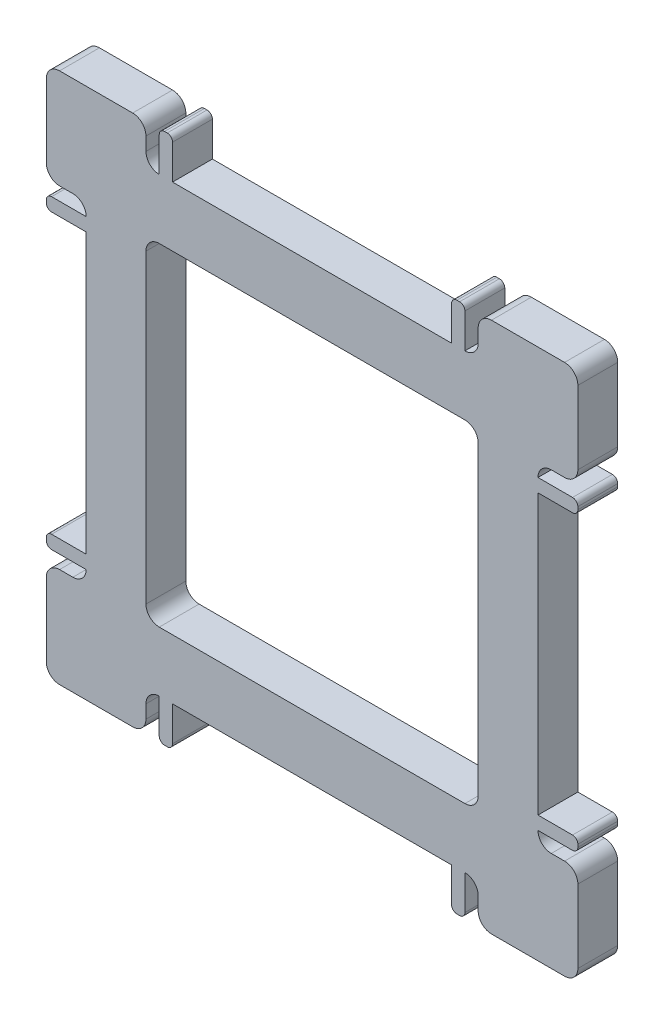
ISO-10303-21;
HEADER;
FILE_DESCRIPTION(('STEP AP214'),'2;1');
FILE_NAME('part.step','',(''),(''),'','','');
FILE_SCHEMA(('AUTOMOTIVE_DESIGN { 1 0 10303 214 1 1 1 1 }'));
ENDSEC;
DATA;
#1=APPLICATION_CONTEXT('core data for automotive mechanical design processes');
#2=APPLICATION_PROTOCOL_DEFINITION('international standard','automotive_design',2000,#1);
#3=PRODUCT_CONTEXT('',#1,'mechanical');
#4=PRODUCT('Part','Part','',(#3));
#5=PRODUCT_RELATED_PRODUCT_CATEGORY('part','',(#4));
#6=PRODUCT_DEFINITION_FORMATION('','',#4);
#7=PRODUCT_DEFINITION_CONTEXT('part definition',#1,'design');
#8=PRODUCT_DEFINITION('design','',#6,#7);
#9=PRODUCT_DEFINITION_SHAPE('','',#8);
#10=(LENGTH_UNIT() NAMED_UNIT(*) SI_UNIT(.MILLI.,.METRE.));
#11=(NAMED_UNIT(*) PLANE_ANGLE_UNIT() SI_UNIT($,.RADIAN.));
#12=(NAMED_UNIT(*) SI_UNIT($,.STERADIAN.) SOLID_ANGLE_UNIT());
#13=UNCERTAINTY_MEASURE_WITH_UNIT(LENGTH_MEASURE(1.E-05),#10,'distance_accuracy_value','');
#14=(GEOMETRIC_REPRESENTATION_CONTEXT(3) GLOBAL_UNCERTAINTY_ASSIGNED_CONTEXT((#13)) GLOBAL_UNIT_ASSIGNED_CONTEXT((#10,
#11,#12)) REPRESENTATION_CONTEXT('',''));
#15=CARTESIAN_POINT('',(0.,0.,0.));
#16=DIRECTION('',(0.,0.,1.));
#17=DIRECTION('',(1.,0.,0.));
#18=AXIS2_PLACEMENT_3D('',#15,#16,#17);
#19=CARTESIAN_POINT('',(-17.,11.5,3.));
#20=DIRECTION('',(1.,0.,0.));
#21=DIRECTION('',(0.,0.,-1.));
#22=AXIS2_PLACEMENT_3D('',#19,#20,#21);
#23=PLANE('',#22);
#24=DIRECTION('',(0.,0.,1.));
#25=VECTOR('',#24,1.);
#26=CARTESIAN_POINT('',(-17.,10.5,0.));
#27=LINE('',#26,#25);
#28=CARTESIAN_POINT('',(-17.,10.5,0.));
#29=VERTEX_POINT('',#28);
#30=CARTESIAN_POINT('',(-17.,10.5,3.));
#31=VERTEX_POINT('',#30);
#32=EDGE_CURVE('E626',#29,#31,#27,.T.);
#33=ORIENTED_EDGE('',*,*,#32,.F.);
#34=DIRECTION('',(0.,-1.,0.));
#35=VECTOR('',#34,1.);
#36=CARTESIAN_POINT('',(-17.,11.5,0.));
#37=LINE('',#36,#35);
#38=CARTESIAN_POINT('',(-17.,-10.5,0.));
#39=VERTEX_POINT('',#38);
#40=EDGE_CURVE('E1120',#29,#39,#37,.T.);
#41=ORIENTED_EDGE('',*,*,#40,.T.);
#42=DIRECTION('',(0.,0.,1.));
#43=VECTOR('',#42,1.);
#44=CARTESIAN_POINT('',(-17.,-10.5,0.));
#45=LINE('',#44,#43);
#46=CARTESIAN_POINT('',(-17.,-10.5,3.));
#47=VERTEX_POINT('',#46);
#48=EDGE_CURVE('E660',#39,#47,#45,.T.);
#49=ORIENTED_EDGE('',*,*,#48,.T.);
#50=DIRECTION('',(0.,-1.,0.));
#51=VECTOR('',#50,1.);
#52=CARTESIAN_POINT('',(-17.,11.5,3.));
#53=LINE('',#52,#51);
#54=EDGE_CURVE('E1035',#31,#47,#53,.T.);
#55=ORIENTED_EDGE('',*,*,#54,.F.);
#56=EDGE_LOOP('',(#33,#41,#49,#55));
#57=FACE_BOUND('',#56,.T.);
#58=ADVANCED_FACE('F37',(#57),#23,.F.);
#59=CARTESIAN_POINT('',(11.5,-17.,3.));
#60=DIRECTION('',(0.,1.,0.));
#61=DIRECTION('',(-1.,0.,0.));
#62=AXIS2_PLACEMENT_3D('',#59,#60,#61);
#63=PLANE('',#62);
#64=DIRECTION('',(0.,0.,1.));
#65=VECTOR('',#64,1.);
#66=CARTESIAN_POINT('',(-10.5,-17.,0.));
#67=LINE('',#66,#65);
#68=CARTESIAN_POINT('',(-10.5,-17.,0.));
#69=VERTEX_POINT('',#68);
#70=CARTESIAN_POINT('',(-10.5,-17.,3.));
#71=VERTEX_POINT('',#70);
#72=EDGE_CURVE('E699',#69,#71,#67,.T.);
#73=ORIENTED_EDGE('',*,*,#72,.F.);
#74=DIRECTION('',(1.,0.,0.));
#75=VECTOR('',#74,1.);
#76=CARTESIAN_POINT('',(11.5,-17.,0.));
#77=LINE('',#76,#75);
#78=CARTESIAN_POINT('',(10.5,-17.,0.));
#79=VERTEX_POINT('',#78);
#80=EDGE_CURVE('E1057',#69,#79,#77,.T.);
#81=ORIENTED_EDGE('',*,*,#80,.T.);
#82=DIRECTION('',(0.,0.,1.));
#83=VECTOR('',#82,1.);
#84=CARTESIAN_POINT('',(10.5,-17.,0.));
#85=LINE('',#84,#83);
#86=CARTESIAN_POINT('',(10.5,-17.,3.));
#87=VERTEX_POINT('',#86);
#88=EDGE_CURVE('E735',#79,#87,#85,.T.);
#89=ORIENTED_EDGE('',*,*,#88,.T.);
#90=DIRECTION('',(1.,0.,0.));
#91=VECTOR('',#90,1.);
#92=CARTESIAN_POINT('',(11.5,-17.,3.));
#93=LINE('',#92,#91);
#94=EDGE_CURVE('E972',#71,#87,#93,.T.);
#95=ORIENTED_EDGE('',*,*,#94,.F.);
#96=EDGE_LOOP('',(#73,#81,#89,#95));
#97=FACE_BOUND('',#96,.T.);
#98=ADVANCED_FACE('F1571',(#97),#63,.F.);
#99=CARTESIAN_POINT('',(17.,11.5,3.));
#100=DIRECTION('',(-1.,0.,0.));
#101=DIRECTION('',(0.,0.,1.));
#102=AXIS2_PLACEMENT_3D('',#99,#100,#101);
#103=PLANE('',#102);
#104=DIRECTION('',(0.,0.,1.));
#105=VECTOR('',#104,1.);
#106=CARTESIAN_POINT('',(17.,-10.5,0.));
#107=LINE('',#106,#105);
#108=CARTESIAN_POINT('',(17.,-10.5,0.));
#109=VERTEX_POINT('',#108);
#110=CARTESIAN_POINT('',(17.,-10.5,3.));
#111=VERTEX_POINT('',#110);
#112=EDGE_CURVE('E775',#109,#111,#107,.T.);
#113=ORIENTED_EDGE('',*,*,#112,.F.);
#114=DIRECTION('',(0.,1.,0.));
#115=VECTOR('',#114,1.);
#116=CARTESIAN_POINT('',(17.,11.5,0.));
#117=LINE('',#116,#115);
#118=CARTESIAN_POINT('',(17.,10.5,0.));
#119=VERTEX_POINT('',#118);
#120=EDGE_CURVE('E1078',#109,#119,#117,.T.);
#121=ORIENTED_EDGE('',*,*,#120,.T.);
#122=DIRECTION('',(0.,0.,1.));
#123=VECTOR('',#122,1.);
#124=CARTESIAN_POINT('',(17.,10.5,0.));
#125=LINE('',#124,#123);
#126=CARTESIAN_POINT('',(17.,10.5,3.));
#127=VERTEX_POINT('',#126);
#128=EDGE_CURVE('E812',#119,#127,#125,.T.);
#129=ORIENTED_EDGE('',*,*,#128,.T.);
#130=DIRECTION('',(0.,1.,0.));
#131=VECTOR('',#130,1.);
#132=CARTESIAN_POINT('',(17.,11.5,3.));
#133=LINE('',#132,#131);
#134=EDGE_CURVE('E993',#111,#127,#133,.T.);
#135=ORIENTED_EDGE('',*,*,#134,.F.);
#136=EDGE_LOOP('',(#113,#121,#129,#135));
#137=FACE_BOUND('',#136,.T.);
#138=ADVANCED_FACE('F1479',(#137),#103,.F.);
#139=CARTESIAN_POINT('',(11.5,17.,3.));
#140=DIRECTION('',(0.,-1.,0.));
#141=DIRECTION('',(1.,0.,0.));
#142=AXIS2_PLACEMENT_3D('',#139,#140,#141);
#143=PLANE('',#142);
#144=DIRECTION('',(0.,0.,1.));
#145=VECTOR('',#144,1.);
#146=CARTESIAN_POINT('',(10.5,17.,0.));
#147=LINE('',#146,#145);
#148=CARTESIAN_POINT('',(10.5,17.,0.));
#149=VERTEX_POINT('',#148);
#150=CARTESIAN_POINT('',(10.5,17.,3.));
#151=VERTEX_POINT('',#150);
#152=EDGE_CURVE('E852',#149,#151,#147,.T.);
#153=ORIENTED_EDGE('',*,*,#152,.F.);
#154=DIRECTION('',(-1.,0.,0.));
#155=VECTOR('',#154,1.);
#156=CARTESIAN_POINT('',(11.5,17.,0.));
#157=LINE('',#156,#155);
#158=CARTESIAN_POINT('',(-10.5,17.,0.));
#159=VERTEX_POINT('',#158);
#160=EDGE_CURVE('E1099',#149,#159,#157,.T.);
#161=ORIENTED_EDGE('',*,*,#160,.T.);
#162=DIRECTION('',(0.,0.,1.));
#163=VECTOR('',#162,1.);
#164=CARTESIAN_POINT('',(-10.5,17.,0.));
#165=LINE('',#164,#163);
#166=CARTESIAN_POINT('',(-10.5,17.,3.));
#167=VERTEX_POINT('',#166);
#168=EDGE_CURVE('E889',#159,#167,#165,.T.);
#169=ORIENTED_EDGE('',*,*,#168,.T.);
#170=DIRECTION('',(-1.,0.,0.));
#171=VECTOR('',#170,1.);
#172=CARTESIAN_POINT('',(11.5,17.,3.));
#173=LINE('',#172,#171);
#174=EDGE_CURVE('E1014',#151,#167,#173,.T.);
#175=ORIENTED_EDGE('',*,*,#174,.F.);
#176=EDGE_LOOP('',(#153,#161,#169,#175));
#177=FACE_BOUND('',#176,.T.);
#178=ADVANCED_FACE('F1387',(#177),#143,.F.);
#179=CARTESIAN_POINT('',(-19.,-19.,3.));
#180=DIRECTION('',(0.,0.,-1.));
#181=DIRECTION('',(-1.,0.,0.));
#182=AXIS2_PLACEMENT_3D('',#179,#180,#181);
#183=PLANE('',#182);
#184=CARTESIAN_POINT('',(-19.,-19.,3.));
#185=DIRECTION('',(0.,0.,1.));
#186=DIRECTION('',(-1.,0.,0.));
#187=AXIS2_PLACEMENT_3D('',#184,#185,#186);
#188=CIRCLE('',#187,1.);
#189=CARTESIAN_POINT('',(-20.,-19.,3.));
#190=VERTEX_POINT('',#189);
#191=CARTESIAN_POINT('',(-19.,-20.,3.));
#192=VERTEX_POINT('',#191);
#193=EDGE_CURVE('E959',#190,#192,#188,.T.);
#194=ORIENTED_EDGE('',*,*,#193,.T.);
#195=DIRECTION('',(1.,0.,0.));
#196=VECTOR('',#195,1.);
#197=CARTESIAN_POINT('',(-19.,-20.,3.));
#198=LINE('',#197,#196);
#199=CARTESIAN_POINT('',(-13.5,-20.,3.));
#200=VERTEX_POINT('',#199);
#201=EDGE_CURVE('E962',#192,#200,#198,.T.);
#202=ORIENTED_EDGE('',*,*,#201,.T.);
#203=CARTESIAN_POINT('',(-13.5,-19.,3.));
#204=DIRECTION('',(0.,0.,1.));
#205=DIRECTION('',(1.,0.,0.));
#206=AXIS2_PLACEMENT_3D('',#203,#204,#205);
#207=CIRCLE('',#206,0.999999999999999);
#208=CARTESIAN_POINT('',(-12.5,-19.,3.));
#209=VERTEX_POINT('',#208);
#210=EDGE_CURVE('E965',#200,#209,#207,.T.);
#211=ORIENTED_EDGE('',*,*,#210,.T.);
#212=DIRECTION('',(0.,1.,0.));
#213=VECTOR('',#212,1.);
#214=CARTESIAN_POINT('',(-12.5,-19.,3.));
#215=LINE('',#214,#213);
#216=CARTESIAN_POINT('',(-12.5,-18.,3.));
#217=VERTEX_POINT('',#216);
#218=EDGE_CURVE('E967',#209,#217,#215,.T.);
#219=ORIENTED_EDGE('',*,*,#218,.T.);
#220=CARTESIAN_POINT('',(-11.5,-18.,3.));
#221=DIRECTION('',(0.,0.,-1.));
#222=DIRECTION('',(-1.,0.,0.));
#223=AXIS2_PLACEMENT_3D('',#220,#221,#222);
#224=CIRCLE('',#223,1.);
#225=CARTESIAN_POINT('',(-11.5,-17.,3.));
#226=VERTEX_POINT('',#225);
#227=EDGE_CURVE('E969',#217,#226,#224,.T.);
#228=ORIENTED_EDGE('',*,*,#227,.T.);
#229=DIRECTION('',(0.,-1.,0.));
#230=VECTOR('',#229,1.);
#231=CARTESIAN_POINT('',(-11.5,0.,3.));
#232=LINE('',#231,#230);
#233=CARTESIAN_POINT('',(-11.5,-19.6,3.));
#234=VERTEX_POINT('',#233);
#235=EDGE_CURVE('E674',#226,#234,#232,.T.);
#236=ORIENTED_EDGE('',*,*,#235,.T.);
#237=CARTESIAN_POINT('',(-11.1,-19.6,3.));
#238=DIRECTION('',(0.,0.,1.));
#239=DIRECTION('',(1.,0.,0.));
#240=AXIS2_PLACEMENT_3D('',#237,#238,#239);
#241=CIRCLE('',#240,0.400000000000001);
#242=CARTESIAN_POINT('',(-11.1,-20.,3.));
#243=VERTEX_POINT('',#242);
#244=EDGE_CURVE('E663',#243,#234,#241,.F.);
#245=ORIENTED_EDGE('',*,*,#244,.F.);
#246=DIRECTION('',(1.,0.,0.));
#247=VECTOR('',#246,1.);
#248=CARTESIAN_POINT('',(3.4694469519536E-13,-19.9999999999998,3.));
#249=LINE('',#248,#247);
#250=CARTESIAN_POINT('',(-10.9,-20.,3.));
#251=VERTEX_POINT('',#250);
#252=EDGE_CURVE('E687',#243,#251,#249,.T.);
#253=ORIENTED_EDGE('',*,*,#252,.T.);
#254=CARTESIAN_POINT('',(-10.9,-19.6,3.));
#255=DIRECTION('',(0.,0.,1.));
#256=DIRECTION('',(1.,0.,0.));
#257=AXIS2_PLACEMENT_3D('',#254,#255,#256);
#258=CIRCLE('',#257,0.399999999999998);
#259=CARTESIAN_POINT('',(-10.5,-19.6,3.));
#260=VERTEX_POINT('',#259);
#261=EDGE_CURVE('E690',#260,#251,#258,.F.);
#262=ORIENTED_EDGE('',*,*,#261,.F.);
#263=DIRECTION('',(0.,-1.,0.));
#264=VECTOR('',#263,1.);
#265=CARTESIAN_POINT('',(-10.5,0.,3.));
#266=LINE('',#265,#264);
#267=EDGE_CURVE('E59',#71,#260,#266,.T.);
#268=ORIENTED_EDGE('',*,*,#267,.F.);
#269=ORIENTED_EDGE('',*,*,#94,.T.);
#270=DIRECTION('',(0.,-1.,0.));
#271=VECTOR('',#270,1.);
#272=CARTESIAN_POINT('',(10.5,0.,3.));
#273=LINE('',#272,#271);
#274=CARTESIAN_POINT('',(10.5,-19.6,3.));
#275=VERTEX_POINT('',#274);
#276=EDGE_CURVE('E698',#87,#275,#273,.T.);
#277=ORIENTED_EDGE('',*,*,#276,.T.);
#278=CARTESIAN_POINT('',(10.9,-19.6,3.));
#279=DIRECTION('',(0.,0.,1.));
#280=DIRECTION('',(1.,0.,0.));
#281=AXIS2_PLACEMENT_3D('',#278,#279,#280);
#282=CIRCLE('',#281,0.399999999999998);
#283=CARTESIAN_POINT('',(10.9,-20.,3.));
#284=VERTEX_POINT('',#283);
#285=EDGE_CURVE('E724',#275,#284,#282,.T.);
#286=ORIENTED_EDGE('',*,*,#285,.T.);
#287=DIRECTION('',(-1.,0.,0.));
#288=VECTOR('',#287,1.);
#289=CARTESIAN_POINT('',(3.46944695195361E-13,-20.0000000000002,3.));
#290=LINE('',#289,#288);
#291=CARTESIAN_POINT('',(11.1,-20.,3.));
#292=VERTEX_POINT('',#291);
#293=EDGE_CURVE('E727',#292,#284,#290,.T.);
#294=ORIENTED_EDGE('',*,*,#293,.F.);
#295=CARTESIAN_POINT('',(11.1,-19.6,3.));
#296=DIRECTION('',(0.,0.,1.));
#297=DIRECTION('',(1.,0.,0.));
#298=AXIS2_PLACEMENT_3D('',#295,#296,#297);
#299=CIRCLE('',#298,0.400000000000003);
#300=CARTESIAN_POINT('',(11.5,-19.6,3.));
#301=VERTEX_POINT('',#300);
#302=EDGE_CURVE('E730',#292,#301,#299,.T.);
#303=ORIENTED_EDGE('',*,*,#302,.T.);
#304=DIRECTION('',(0.,-1.,0.));
#305=VECTOR('',#304,1.);
#306=CARTESIAN_POINT('',(11.5,0.,3.));
#307=LINE('',#306,#305);
#308=CARTESIAN_POINT('',(11.5,-17.,3.));
#309=VERTEX_POINT('',#308);
#310=EDGE_CURVE('E711',#309,#301,#307,.T.);
#311=ORIENTED_EDGE('',*,*,#310,.F.);
#312=CARTESIAN_POINT('',(11.5,-18.,3.));
#313=DIRECTION('',(0.,0.,-1.));
#314=DIRECTION('',(1.,0.,0.));
#315=AXIS2_PLACEMENT_3D('',#312,#313,#314);
#316=CIRCLE('',#315,1.);
#317=CARTESIAN_POINT('',(12.5,-18.,3.));
#318=VERTEX_POINT('',#317);
#319=EDGE_CURVE('E974',#309,#318,#316,.T.);
#320=ORIENTED_EDGE('',*,*,#319,.T.);
#321=DIRECTION('',(0.,-1.,0.));
#322=VECTOR('',#321,1.);
#323=CARTESIAN_POINT('',(12.5,-19.,3.));
#324=LINE('',#323,#322);
#325=CARTESIAN_POINT('',(12.5,-19.,3.));
#326=VERTEX_POINT('',#325);
#327=EDGE_CURVE('E976',#318,#326,#324,.T.);
#328=ORIENTED_EDGE('',*,*,#327,.T.);
#329=CARTESIAN_POINT('',(13.5,-19.,3.));
#330=DIRECTION('',(0.,0.,1.));
#331=DIRECTION('',(-1.,0.,0.));
#332=AXIS2_PLACEMENT_3D('',#329,#330,#331);
#333=CIRCLE('',#332,0.999999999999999);
#334=CARTESIAN_POINT('',(13.5,-20.,3.));
#335=VERTEX_POINT('',#334);
#336=EDGE_CURVE('E978',#326,#335,#333,.T.);
#337=ORIENTED_EDGE('',*,*,#336,.T.);
#338=DIRECTION('',(1.,0.,0.));
#339=VECTOR('',#338,1.);
#340=CARTESIAN_POINT('',(13.5,-20.,3.));
#341=LINE('',#340,#339);
#342=CARTESIAN_POINT('',(19.,-20.,3.));
#343=VERTEX_POINT('',#342);
#344=EDGE_CURVE('E980',#335,#343,#341,.T.);
#345=ORIENTED_EDGE('',*,*,#344,.T.);
#346=CARTESIAN_POINT('',(19.,-19.,3.));
#347=DIRECTION('',(0.,0.,1.));
#348=DIRECTION('',(1.,0.,0.));
#349=AXIS2_PLACEMENT_3D('',#346,#347,#348);
#350=CIRCLE('',#349,1.);
#351=CARTESIAN_POINT('',(20.,-19.,3.));
#352=VERTEX_POINT('',#351);
#353=EDGE_CURVE('E982',#343,#352,#350,.T.);
#354=ORIENTED_EDGE('',*,*,#353,.T.);
#355=DIRECTION('',(0.,1.,0.));
#356=VECTOR('',#355,1.);
#357=CARTESIAN_POINT('',(20.,-13.5,3.));
#358=LINE('',#357,#356);
#359=CARTESIAN_POINT('',(20.,-13.5,3.));
#360=VERTEX_POINT('',#359);
#361=EDGE_CURVE('E984',#352,#360,#358,.T.);
#362=ORIENTED_EDGE('',*,*,#361,.T.);
#363=CARTESIAN_POINT('',(19.,-13.5,3.));
#364=DIRECTION('',(0.,0.,1.));
#365=DIRECTION('',(1.,0.,0.));
#366=AXIS2_PLACEMENT_3D('',#363,#364,#365);
#367=CIRCLE('',#366,1.);
#368=CARTESIAN_POINT('',(19.,-12.5,3.));
#369=VERTEX_POINT('',#368);
#370=EDGE_CURVE('E986',#360,#369,#367,.T.);
#371=ORIENTED_EDGE('',*,*,#370,.T.);
#372=DIRECTION('',(-1.,0.,0.));
#373=VECTOR('',#372,1.);
#374=CARTESIAN_POINT('',(19.,-12.5,3.));
#375=LINE('',#374,#373);
#376=CARTESIAN_POINT('',(18.,-12.5,3.));
#377=VERTEX_POINT('',#376);
#378=EDGE_CURVE('E988',#369,#377,#375,.T.);
#379=ORIENTED_EDGE('',*,*,#378,.T.);
#380=CARTESIAN_POINT('',(18.,-11.5,3.));
#381=DIRECTION('',(0.,0.,-1.));
#382=DIRECTION('',(-1.,0.,0.));
#383=AXIS2_PLACEMENT_3D('',#380,#381,#382);
#384=CIRCLE('',#383,1.);
#385=CARTESIAN_POINT('',(17.,-11.5,3.));
#386=VERTEX_POINT('',#385);
#387=EDGE_CURVE('E990',#377,#386,#384,.T.);
#388=ORIENTED_EDGE('',*,*,#387,.T.);
#389=DIRECTION('',(1.,0.,0.));
#390=VECTOR('',#389,1.);
#391=CARTESIAN_POINT('',(0.,-11.5,3.));
#392=LINE('',#391,#390);
#393=CARTESIAN_POINT('',(19.6,-11.5,3.));
#394=VERTEX_POINT('',#393);
#395=EDGE_CURVE('E749',#386,#394,#392,.T.);
#396=ORIENTED_EDGE('',*,*,#395,.T.);
#397=CARTESIAN_POINT('',(19.6,-11.1,3.));
#398=DIRECTION('',(0.,0.,1.));
#399=DIRECTION('',(1.,0.,0.));
#400=AXIS2_PLACEMENT_3D('',#397,#398,#399);
#401=CIRCLE('',#400,0.400000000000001);
#402=CARTESIAN_POINT('',(20.,-11.1,3.));
#403=VERTEX_POINT('',#402);
#404=EDGE_CURVE('E738',#403,#394,#401,.F.);
#405=ORIENTED_EDGE('',*,*,#404,.F.);
#406=DIRECTION('',(0.,1.,0.));
#407=VECTOR('',#406,1.);
#408=CARTESIAN_POINT('',(20.,0.,3.));
#409=LINE('',#408,#407);
#410=CARTESIAN_POINT('',(20.,-10.9,3.));
#411=VERTEX_POINT('',#410);
#412=EDGE_CURVE('E762',#403,#411,#409,.T.);
#413=ORIENTED_EDGE('',*,*,#412,.T.);
#414=CARTESIAN_POINT('',(19.6,-10.9,3.));
#415=DIRECTION('',(0.,0.,1.));
#416=DIRECTION('',(1.,0.,0.));
#417=AXIS2_PLACEMENT_3D('',#414,#415,#416);
#418=CIRCLE('',#417,0.4);
#419=CARTESIAN_POINT('',(19.6,-10.5,3.));
#420=VERTEX_POINT('',#419);
#421=EDGE_CURVE('E765',#420,#411,#418,.F.);
#422=ORIENTED_EDGE('',*,*,#421,.F.);
#423=DIRECTION('',(1.,0.,0.));
#424=VECTOR('',#423,1.);
#425=CARTESIAN_POINT('',(0.,-10.5,3.));
#426=LINE('',#425,#424);
#427=EDGE_CURVE('E768',#111,#420,#426,.T.);
#428=ORIENTED_EDGE('',*,*,#427,.F.);
#429=ORIENTED_EDGE('',*,*,#134,.T.);
#430=DIRECTION('',(1.,0.,0.));
#431=VECTOR('',#430,1.);
#432=CARTESIAN_POINT('',(0.,10.5,3.));
#433=LINE('',#432,#431);
#434=CARTESIAN_POINT('',(19.6,10.5,3.));
#435=VERTEX_POINT('',#434);
#436=EDGE_CURVE('E774',#127,#435,#433,.T.);
#437=ORIENTED_EDGE('',*,*,#436,.T.);
#438=CARTESIAN_POINT('',(19.6,10.9,3.));
#439=DIRECTION('',(0.,0.,1.));
#440=DIRECTION('',(1.,0.,0.));
#441=AXIS2_PLACEMENT_3D('',#438,#439,#440);
#442=CIRCLE('',#441,0.4);
#443=CARTESIAN_POINT('',(20.,10.9,3.));
#444=VERTEX_POINT('',#443);
#445=EDGE_CURVE('E801',#435,#444,#442,.T.);
#446=ORIENTED_EDGE('',*,*,#445,.T.);
#447=DIRECTION('',(0.,-1.,0.));
#448=VECTOR('',#447,1.);
#449=CARTESIAN_POINT('',(20.,0.,3.));
#450=LINE('',#449,#448);
#451=CARTESIAN_POINT('',(20.,11.1,3.));
#452=VERTEX_POINT('',#451);
#453=EDGE_CURVE('E804',#452,#444,#450,.T.);
#454=ORIENTED_EDGE('',*,*,#453,.F.);
#455=CARTESIAN_POINT('',(19.6,11.1,3.));
#456=DIRECTION('',(0.,0.,1.));
#457=DIRECTION('',(1.,0.,0.));
#458=AXIS2_PLACEMENT_3D('',#455,#456,#457);
#459=CIRCLE('',#458,0.400000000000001);
#460=CARTESIAN_POINT('',(19.6,11.5,3.));
#461=VERTEX_POINT('',#460);
#462=EDGE_CURVE('E807',#452,#461,#459,.T.);
#463=ORIENTED_EDGE('',*,*,#462,.T.);
#464=DIRECTION('',(1.,0.,0.));
#465=VECTOR('',#464,1.);
#466=CARTESIAN_POINT('',(0.,11.5,3.));
#467=LINE('',#466,#465);
#468=CARTESIAN_POINT('',(17.,11.5,3.));
#469=VERTEX_POINT('',#468);
#470=EDGE_CURVE('E788',#469,#461,#467,.T.);
#471=ORIENTED_EDGE('',*,*,#470,.F.);
#472=CARTESIAN_POINT('',(18.,11.5,3.));
#473=DIRECTION('',(0.,0.,-1.));
#474=DIRECTION('',(-1.,0.,0.));
#475=AXIS2_PLACEMENT_3D('',#472,#473,#474);
#476=CIRCLE('',#475,1.);
#477=CARTESIAN_POINT('',(18.,12.5,3.));
#478=VERTEX_POINT('',#477);
#479=EDGE_CURVE('E995',#469,#478,#476,.T.);
#480=ORIENTED_EDGE('',*,*,#479,.T.);
#481=DIRECTION('',(1.,0.,0.));
#482=VECTOR('',#481,1.);
#483=CARTESIAN_POINT('',(19.,12.5,3.));
#484=LINE('',#483,#482);
#485=CARTESIAN_POINT('',(19.,12.5,3.));
#486=VERTEX_POINT('',#485);
#487=EDGE_CURVE('E997',#478,#486,#484,.T.);
#488=ORIENTED_EDGE('',*,*,#487,.T.);
#489=CARTESIAN_POINT('',(19.,13.5,3.));
#490=DIRECTION('',(0.,0.,1.));
#491=DIRECTION('',(1.,0.,0.));
#492=AXIS2_PLACEMENT_3D('',#489,#490,#491);
#493=CIRCLE('',#492,1.);
#494=CARTESIAN_POINT('',(20.,13.5,3.));
#495=VERTEX_POINT('',#494);
#496=EDGE_CURVE('E999',#486,#495,#493,.T.);
#497=ORIENTED_EDGE('',*,*,#496,.T.);
#498=DIRECTION('',(0.,1.,0.));
#499=VECTOR('',#498,1.);
#500=CARTESIAN_POINT('',(20.,19.,3.));
#501=LINE('',#500,#499);
#502=CARTESIAN_POINT('',(20.,19.,3.));
#503=VERTEX_POINT('',#502);
#504=EDGE_CURVE('E1001',#495,#503,#501,.T.);
#505=ORIENTED_EDGE('',*,*,#504,.T.);
#506=CARTESIAN_POINT('',(19.,19.,3.));
#507=DIRECTION('',(0.,0.,1.));
#508=DIRECTION('',(1.,0.,0.));
#509=AXIS2_PLACEMENT_3D('',#506,#507,#508);
#510=CIRCLE('',#509,1.);
#511=CARTESIAN_POINT('',(19.,20.,3.));
#512=VERTEX_POINT('',#511);
#513=EDGE_CURVE('E1003',#503,#512,#510,.T.);
#514=ORIENTED_EDGE('',*,*,#513,.T.);
#515=DIRECTION('',(-1.,0.,0.));
#516=VECTOR('',#515,1.);
#517=CARTESIAN_POINT('',(13.5,20.,3.));
#518=LINE('',#517,#516);
#519=CARTESIAN_POINT('',(13.5,20.,3.));
#520=VERTEX_POINT('',#519);
#521=EDGE_CURVE('E1005',#512,#520,#518,.T.);
#522=ORIENTED_EDGE('',*,*,#521,.T.);
#523=CARTESIAN_POINT('',(13.5,19.,3.));
#524=DIRECTION('',(0.,0.,1.));
#525=DIRECTION('',(-1.,0.,0.));
#526=AXIS2_PLACEMENT_3D('',#523,#524,#525);
#527=CIRCLE('',#526,1.);
#528=CARTESIAN_POINT('',(12.5,19.,3.));
#529=VERTEX_POINT('',#528);
#530=EDGE_CURVE('E1007',#520,#529,#527,.T.);
#531=ORIENTED_EDGE('',*,*,#530,.T.);
#532=DIRECTION('',(0.,-1.,0.));
#533=VECTOR('',#532,1.);
#534=CARTESIAN_POINT('',(12.5,19.,3.));
#535=LINE('',#534,#533);
#536=CARTESIAN_POINT('',(12.5,18.,3.));
#537=VERTEX_POINT('',#536);
#538=EDGE_CURVE('E1009',#529,#537,#535,.T.);
#539=ORIENTED_EDGE('',*,*,#538,.T.);
#540=CARTESIAN_POINT('',(11.5,18.,3.));
#541=DIRECTION('',(0.,0.,-1.));
#542=DIRECTION('',(-1.,0.,0.));
#543=AXIS2_PLACEMENT_3D('',#540,#541,#542);
#544=CIRCLE('',#543,1.);
#545=CARTESIAN_POINT('',(11.5,17.,3.));
#546=VERTEX_POINT('',#545);
#547=EDGE_CURVE('E1011',#537,#546,#544,.T.);
#548=ORIENTED_EDGE('',*,*,#547,.T.);
#549=DIRECTION('',(0.,1.,0.));
#550=VECTOR('',#549,1.);
#551=CARTESIAN_POINT('',(11.5000000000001,0.,3.));
#552=LINE('',#551,#550);
#553=CARTESIAN_POINT('',(11.5,19.6,3.));
#554=VERTEX_POINT('',#553);
#555=EDGE_CURVE('E826',#546,#554,#552,.T.);
#556=ORIENTED_EDGE('',*,*,#555,.T.);
#557=CARTESIAN_POINT('',(11.1,19.6,3.));
#558=DIRECTION('',(0.,0.,1.));
#559=DIRECTION('',(1.,0.,0.));
#560=AXIS2_PLACEMENT_3D('',#557,#558,#559);
#561=CIRCLE('',#560,0.399999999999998);
#562=CARTESIAN_POINT('',(11.1,20.,3.));
#563=VERTEX_POINT('',#562);
#564=EDGE_CURVE('E815',#563,#554,#561,.F.);
#565=ORIENTED_EDGE('',*,*,#564,.F.);
#566=DIRECTION('',(-1.,0.,0.));
#567=VECTOR('',#566,1.);
#568=CARTESIAN_POINT('',(6.93889390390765E-13,20.0000000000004,3.));
#569=LINE('',#568,#567);
#570=CARTESIAN_POINT('',(10.9,20.,3.));
#571=VERTEX_POINT('',#570);
#572=EDGE_CURVE('E839',#563,#571,#569,.T.);
#573=ORIENTED_EDGE('',*,*,#572,.T.);
#574=CARTESIAN_POINT('',(10.9,19.6,3.));
#575=DIRECTION('',(0.,0.,1.));
#576=DIRECTION('',(1.,0.,0.));
#577=AXIS2_PLACEMENT_3D('',#574,#575,#576);
#578=CIRCLE('',#577,0.400000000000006);
#579=CARTESIAN_POINT('',(10.5,19.6,3.));
#580=VERTEX_POINT('',#579);
#581=EDGE_CURVE('E842',#580,#571,#578,.F.);
#582=ORIENTED_EDGE('',*,*,#581,.F.);
#583=DIRECTION('',(0.,1.,0.));
#584=VECTOR('',#583,1.);
#585=CARTESIAN_POINT('',(10.5000000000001,0.,3.));
#586=LINE('',#585,#584);
#587=EDGE_CURVE('E845',#151,#580,#586,.T.);
#588=ORIENTED_EDGE('',*,*,#587,.F.);
#589=ORIENTED_EDGE('',*,*,#174,.T.);
#590=DIRECTION('',(0.,1.,0.));
#591=VECTOR('',#590,1.);
#592=CARTESIAN_POINT('',(-10.5,0.,3.));
#593=LINE('',#592,#591);
#594=CARTESIAN_POINT('',(-10.5,19.6,3.));
#595=VERTEX_POINT('',#594);
#596=EDGE_CURVE('E851',#167,#595,#593,.T.);
#597=ORIENTED_EDGE('',*,*,#596,.T.);
#598=CARTESIAN_POINT('',(-10.9,19.6,3.));
#599=DIRECTION('',(0.,0.,1.));
#600=DIRECTION('',(1.,0.,0.));
#601=AXIS2_PLACEMENT_3D('',#598,#599,#600);
#602=CIRCLE('',#601,0.400000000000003);
#603=CARTESIAN_POINT('',(-10.9,20.,3.));
#604=VERTEX_POINT('',#603);
#605=EDGE_CURVE('E878',#595,#604,#602,.T.);
#606=ORIENTED_EDGE('',*,*,#605,.T.);
#607=DIRECTION('',(1.,0.,0.));
#608=VECTOR('',#607,1.);
#609=CARTESIAN_POINT('',(-6.93889390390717E-13,20.0000000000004,3.));
#610=LINE('',#609,#608);
#611=CARTESIAN_POINT('',(-11.1,20.,3.));
#612=VERTEX_POINT('',#611);
#613=EDGE_CURVE('E881',#612,#604,#610,.T.);
#614=ORIENTED_EDGE('',*,*,#613,.F.);
#615=CARTESIAN_POINT('',(-11.1,19.6,3.));
#616=DIRECTION('',(0.,0.,1.));
#617=DIRECTION('',(1.,0.,0.));
#618=AXIS2_PLACEMENT_3D('',#615,#616,#617);
#619=CIRCLE('',#618,0.400000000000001);
#620=CARTESIAN_POINT('',(-11.5,19.6,3.));
#621=VERTEX_POINT('',#620);
#622=EDGE_CURVE('E884',#612,#621,#619,.T.);
#623=ORIENTED_EDGE('',*,*,#622,.T.);
#624=DIRECTION('',(0.,1.,0.));
#625=VECTOR('',#624,1.);
#626=CARTESIAN_POINT('',(-11.5,0.,3.));
#627=LINE('',#626,#625);
#628=CARTESIAN_POINT('',(-11.5,17.,3.));
#629=VERTEX_POINT('',#628);
#630=EDGE_CURVE('E865',#629,#621,#627,.T.);
#631=ORIENTED_EDGE('',*,*,#630,.F.);
#632=CARTESIAN_POINT('',(-11.5,18.,3.));
#633=DIRECTION('',(0.,0.,-1.));
#634=DIRECTION('',(1.,0.,0.));
#635=AXIS2_PLACEMENT_3D('',#632,#633,#634);
#636=CIRCLE('',#635,1.);
#637=CARTESIAN_POINT('',(-12.5,18.,3.));
#638=VERTEX_POINT('',#637);
#639=EDGE_CURVE('E1016',#629,#638,#636,.T.);
#640=ORIENTED_EDGE('',*,*,#639,.T.);
#641=DIRECTION('',(0.,1.,0.));
#642=VECTOR('',#641,1.);
#643=CARTESIAN_POINT('',(-12.5,19.,3.));
#644=LINE('',#643,#642);
#645=CARTESIAN_POINT('',(-12.5,19.,3.));
#646=VERTEX_POINT('',#645);
#647=EDGE_CURVE('E1018',#638,#646,#644,.T.);
#648=ORIENTED_EDGE('',*,*,#647,.T.);
#649=CARTESIAN_POINT('',(-13.5,19.,3.));
#650=DIRECTION('',(0.,0.,1.));
#651=DIRECTION('',(1.,0.,0.));
#652=AXIS2_PLACEMENT_3D('',#649,#650,#651);
#653=CIRCLE('',#652,0.999999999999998);
#654=CARTESIAN_POINT('',(-13.5,20.,3.));
#655=VERTEX_POINT('',#654);
#656=EDGE_CURVE('E1020',#646,#655,#653,.T.);
#657=ORIENTED_EDGE('',*,*,#656,.T.);
#658=DIRECTION('',(-1.,0.,0.));
#659=VECTOR('',#658,1.);
#660=CARTESIAN_POINT('',(-19.,20.,3.));
#661=LINE('',#660,#659);
#662=CARTESIAN_POINT('',(-19.,20.,3.));
#663=VERTEX_POINT('',#662);
#664=EDGE_CURVE('E1022',#655,#663,#661,.T.);
#665=ORIENTED_EDGE('',*,*,#664,.T.);
#666=CARTESIAN_POINT('',(-19.,19.,3.));
#667=DIRECTION('',(0.,0.,1.));
#668=DIRECTION('',(1.,0.,0.));
#669=AXIS2_PLACEMENT_3D('',#666,#667,#668);
#670=CIRCLE('',#669,1.);
#671=CARTESIAN_POINT('',(-20.,19.,3.));
#672=VERTEX_POINT('',#671);
#673=EDGE_CURVE('E1024',#663,#672,#670,.T.);
#674=ORIENTED_EDGE('',*,*,#673,.T.);
#675=DIRECTION('',(0.,-1.,0.));
#676=VECTOR('',#675,1.);
#677=CARTESIAN_POINT('',(-20.,19.,3.));
#678=LINE('',#677,#676);
#679=CARTESIAN_POINT('',(-20.,13.5,3.));
#680=VERTEX_POINT('',#679);
#681=EDGE_CURVE('E1026',#672,#680,#678,.T.);
#682=ORIENTED_EDGE('',*,*,#681,.T.);
#683=CARTESIAN_POINT('',(-19.,13.5,3.));
#684=DIRECTION('',(0.,0.,1.));
#685=DIRECTION('',(-1.,0.,0.));
#686=AXIS2_PLACEMENT_3D('',#683,#684,#685);
#687=CIRCLE('',#686,1.);
#688=CARTESIAN_POINT('',(-19.,12.5,3.));
#689=VERTEX_POINT('',#688);
#690=EDGE_CURVE('E1028',#680,#689,#687,.T.);
#691=ORIENTED_EDGE('',*,*,#690,.T.);
#692=DIRECTION('',(1.,0.,0.));
#693=VECTOR('',#692,1.);
#694=CARTESIAN_POINT('',(-19.,12.5,3.));
#695=LINE('',#694,#693);
#696=CARTESIAN_POINT('',(-18.,12.5,3.));
#697=VERTEX_POINT('',#696);
#698=EDGE_CURVE('E1030',#689,#697,#695,.T.);
#699=ORIENTED_EDGE('',*,*,#698,.T.);
#700=CARTESIAN_POINT('',(-18.,11.5,3.));
#701=DIRECTION('',(0.,0.,-1.));
#702=DIRECTION('',(1.,0.,0.));
#703=AXIS2_PLACEMENT_3D('',#700,#701,#702);
#704=CIRCLE('',#703,1.);
#705=CARTESIAN_POINT('',(-17.,11.5,3.));
#706=VERTEX_POINT('',#705);
#707=EDGE_CURVE('E1032',#697,#706,#704,.T.);
#708=ORIENTED_EDGE('',*,*,#707,.T.);
#709=DIRECTION('',(-1.,0.,0.));
#710=VECTOR('',#709,1.);
#711=CARTESIAN_POINT('',(0.,11.5,3.));
#712=LINE('',#711,#710);
#713=CARTESIAN_POINT('',(-19.6,11.5,3.));
#714=VERTEX_POINT('',#713);
#715=EDGE_CURVE('E601',#706,#714,#712,.T.);
#716=ORIENTED_EDGE('',*,*,#715,.T.);
#717=CARTESIAN_POINT('',(-19.6,11.1,3.));
#718=DIRECTION('',(0.,0.,1.));
#719=DIRECTION('',(1.,0.,0.));
#720=AXIS2_PLACEMENT_3D('',#717,#718,#719);
#721=CIRCLE('',#720,0.400000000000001);
#722=CARTESIAN_POINT('',(-20.,11.1,3.));
#723=VERTEX_POINT('',#722);
#724=EDGE_CURVE('E615',#723,#714,#721,.F.);
#725=ORIENTED_EDGE('',*,*,#724,.F.);
#726=DIRECTION('',(0.,-1.,0.));
#727=VECTOR('',#726,1.);
#728=CARTESIAN_POINT('',(-20.,0.,3.));
#729=LINE('',#728,#727);
#730=CARTESIAN_POINT('',(-20.,10.9,3.));
#731=VERTEX_POINT('',#730);
#732=EDGE_CURVE('E587',#723,#731,#729,.T.);
#733=ORIENTED_EDGE('',*,*,#732,.T.);
#734=CARTESIAN_POINT('',(-19.6,10.9,3.));
#735=DIRECTION('',(0.,0.,1.));
#736=DIRECTION('',(1.,0.,0.));
#737=AXIS2_PLACEMENT_3D('',#734,#735,#736);
#738=CIRCLE('',#737,0.4);
#739=CARTESIAN_POINT('',(-19.6,10.5,3.));
#740=VERTEX_POINT('',#739);
#741=EDGE_CURVE('E618',#740,#731,#738,.F.);
#742=ORIENTED_EDGE('',*,*,#741,.F.);
#743=DIRECTION('',(-1.,0.,0.));
#744=VECTOR('',#743,1.);
#745=CARTESIAN_POINT('',(0.,10.5,3.));
#746=LINE('',#745,#744);
#747=EDGE_CURVE('E52',#31,#740,#746,.T.);
#748=ORIENTED_EDGE('',*,*,#747,.F.);
#749=ORIENTED_EDGE('',*,*,#54,.T.);
#750=DIRECTION('',(-1.,0.,0.));
#751=VECTOR('',#750,1.);
#752=CARTESIAN_POINT('',(0.,-10.5,3.));
#753=LINE('',#752,#751);
#754=CARTESIAN_POINT('',(-19.6,-10.5,3.));
#755=VERTEX_POINT('',#754);
#756=EDGE_CURVE('E625',#47,#755,#753,.T.);
#757=ORIENTED_EDGE('',*,*,#756,.T.);
#758=CARTESIAN_POINT('',(-19.6,-10.9,3.));
#759=DIRECTION('',(0.,0.,1.));
#760=DIRECTION('',(1.,0.,0.));
#761=AXIS2_PLACEMENT_3D('',#758,#759,#760);
#762=CIRCLE('',#761,0.4);
#763=CARTESIAN_POINT('',(-20.,-10.9,3.));
#764=VERTEX_POINT('',#763);
#765=EDGE_CURVE('E649',#755,#764,#762,.T.);
#766=ORIENTED_EDGE('',*,*,#765,.T.);
#767=DIRECTION('',(0.,1.,0.));
#768=VECTOR('',#767,1.);
#769=CARTESIAN_POINT('',(-20.,0.,3.));
#770=LINE('',#769,#768);
#771=CARTESIAN_POINT('',(-20.,-11.1,3.));
#772=VERTEX_POINT('',#771);
#773=EDGE_CURVE('E652',#772,#764,#770,.T.);
#774=ORIENTED_EDGE('',*,*,#773,.F.);
#775=CARTESIAN_POINT('',(-19.6,-11.1,3.));
#776=DIRECTION('',(0.,0.,1.));
#777=DIRECTION('',(1.,0.,0.));
#778=AXIS2_PLACEMENT_3D('',#775,#776,#777);
#779=CIRCLE('',#778,0.400000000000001);
#780=CARTESIAN_POINT('',(-19.6,-11.5,3.));
#781=VERTEX_POINT('',#780);
#782=EDGE_CURVE('E655',#772,#781,#779,.T.);
#783=ORIENTED_EDGE('',*,*,#782,.T.);
#784=DIRECTION('',(-1.,0.,0.));
#785=VECTOR('',#784,1.);
#786=CARTESIAN_POINT('',(0.,-11.5,3.));
#787=LINE('',#786,#785);
#788=CARTESIAN_POINT('',(-17.,-11.5,3.));
#789=VERTEX_POINT('',#788);
#790=EDGE_CURVE('E636',#789,#781,#787,.T.);
#791=ORIENTED_EDGE('',*,*,#790,.F.);
#792=CARTESIAN_POINT('',(-18.,-11.5,3.));
#793=DIRECTION('',(0.,0.,-1.));
#794=DIRECTION('',(1.,0.,0.));
#795=AXIS2_PLACEMENT_3D('',#792,#793,#794);
#796=CIRCLE('',#795,1.);
#797=CARTESIAN_POINT('',(-18.,-12.5,3.));
#798=VERTEX_POINT('',#797);
#799=EDGE_CURVE('E1037',#789,#798,#796,.T.);
#800=ORIENTED_EDGE('',*,*,#799,.T.);
#801=DIRECTION('',(-1.,0.,0.));
#802=VECTOR('',#801,1.);
#803=CARTESIAN_POINT('',(-19.,-12.5,3.));
#804=LINE('',#803,#802);
#805=CARTESIAN_POINT('',(-19.,-12.5,3.));
#806=VERTEX_POINT('',#805);
#807=EDGE_CURVE('E1039',#798,#806,#804,.T.);
#808=ORIENTED_EDGE('',*,*,#807,.T.);
#809=CARTESIAN_POINT('',(-19.,-13.5,3.));
#810=DIRECTION('',(0.,0.,1.));
#811=DIRECTION('',(-1.,0.,0.));
#812=AXIS2_PLACEMENT_3D('',#809,#810,#811);
#813=CIRCLE('',#812,1.);
#814=CARTESIAN_POINT('',(-20.,-13.5,3.));
#815=VERTEX_POINT('',#814);
#816=EDGE_CURVE('E1041',#806,#815,#813,.T.);
#817=ORIENTED_EDGE('',*,*,#816,.T.);
#818=DIRECTION('',(0.,-1.,0.));
#819=VECTOR('',#818,1.);
#820=CARTESIAN_POINT('',(-20.,-13.5,3.));
#821=LINE('',#820,#819);
#822=EDGE_CURVE('E1043',#815,#190,#821,.T.);
#823=ORIENTED_EDGE('',*,*,#822,.T.);
#824=EDGE_LOOP('',(#194,#202,#211,#219,#228,#236,#245,#253,#262,#268,#269,#277,#286,#294,#303,
#311,#320,#328,#337,#345,#354,#362,#371,#379,#388,#396,#405,#413,#422,#428,#429,#437,#446,#454,
#463,#471,#480,#488,#497,#505,#514,#522,#531,#539,#548,#556,#565,#573,#582,#588,#589,#597,#606,
#614,#623,#631,#640,#648,#657,#665,#674,#682,#691,#699,#708,#716,#725,#733,#742,#748,#749,#757,
#766,#774,#783,#791,#800,#808,#817,#823));
#825=FACE_BOUND('',#824,.T.);
#826=CARTESIAN_POINT('',(11.5,-11.5,3.));
#827=DIRECTION('',(0.,0.,1.));
#828=DIRECTION('',(1.,0.,0.));
#829=AXIS2_PLACEMENT_3D('',#826,#827,#828);
#830=CIRCLE('',#829,1.);
#831=CARTESIAN_POINT('',(11.5,-12.5,3.));
#832=VERTEX_POINT('',#831);
#833=CARTESIAN_POINT('',(12.5,-11.5,3.));
#834=VERTEX_POINT('',#833);
#835=EDGE_CURVE('E900',#832,#834,#830,.T.);
#836=ORIENTED_EDGE('',*,*,#835,.F.);
#837=DIRECTION('',(1.,0.,0.));
#838=VECTOR('',#837,1.);
#839=CARTESIAN_POINT('',(-11.5,-12.5,3.));
#840=LINE('',#839,#838);
#841=CARTESIAN_POINT('',(-11.5,-12.5,3.));
#842=VERTEX_POINT('',#841);
#843=EDGE_CURVE('E916',#842,#832,#840,.T.);
#844=ORIENTED_EDGE('',*,*,#843,.F.);
#845=CARTESIAN_POINT('',(-11.5,-11.5,3.));
#846=DIRECTION('',(0.,0.,1.));
#847=DIRECTION('',(1.,0.,0.));
#848=AXIS2_PLACEMENT_3D('',#845,#846,#847);
#849=CIRCLE('',#848,1.);
#850=CARTESIAN_POINT('',(-12.5,-11.5,3.));
#851=VERTEX_POINT('',#850);
#852=EDGE_CURVE('E913',#851,#842,#849,.T.);
#853=ORIENTED_EDGE('',*,*,#852,.F.);
#854=DIRECTION('',(0.,-1.,0.));
#855=VECTOR('',#854,1.);
#856=CARTESIAN_POINT('',(-12.5,11.5,3.));
#857=LINE('',#856,#855);
#858=CARTESIAN_POINT('',(-12.5,11.5,3.));
#859=VERTEX_POINT('',#858);
#860=EDGE_CURVE('E911',#859,#851,#857,.T.);
#861=ORIENTED_EDGE('',*,*,#860,.F.);
#862=CARTESIAN_POINT('',(-11.5,11.5,3.));
#863=DIRECTION('',(0.,0.,1.));
#864=DIRECTION('',(-1.,0.,0.));
#865=AXIS2_PLACEMENT_3D('',#862,#863,#864);
#866=CIRCLE('',#865,1.);
#867=CARTESIAN_POINT('',(-11.5,12.5,3.));
#868=VERTEX_POINT('',#867);
#869=EDGE_CURVE('E909',#868,#859,#866,.T.);
#870=ORIENTED_EDGE('',*,*,#869,.F.);
#871=DIRECTION('',(-1.,0.,0.));
#872=VECTOR('',#871,1.);
#873=CARTESIAN_POINT('',(-11.5,12.5,3.));
#874=LINE('',#873,#872);
#875=CARTESIAN_POINT('',(11.5,12.5,3.));
#876=VERTEX_POINT('',#875);
#877=EDGE_CURVE('E907',#876,#868,#874,.T.);
#878=ORIENTED_EDGE('',*,*,#877,.F.);
#879=CARTESIAN_POINT('',(11.5,11.5,3.));
#880=DIRECTION('',(0.,0.,1.));
#881=DIRECTION('',(1.,0.,0.));
#882=AXIS2_PLACEMENT_3D('',#879,#880,#881);
#883=CIRCLE('',#882,1.);
#884=CARTESIAN_POINT('',(12.5,11.5,3.));
#885=VERTEX_POINT('',#884);
#886=EDGE_CURVE('E905',#885,#876,#883,.T.);
#887=ORIENTED_EDGE('',*,*,#886,.F.);
#888=DIRECTION('',(0.,1.,0.));
#889=VECTOR('',#888,1.);
#890=CARTESIAN_POINT('',(12.5,11.5,3.));
#891=LINE('',#890,#889);
#892=EDGE_CURVE('E902',#834,#885,#891,.T.);
#893=ORIENTED_EDGE('',*,*,#892,.F.);
#894=EDGE_LOOP('',(#836,#844,#853,#861,#870,#878,#887,#893));
#895=FACE_BOUND('',#894,.T.);
#896=ADVANCED_FACE('F1256',(#825,#895),#183,.F.);
#897=CARTESIAN_POINT('',(-19.,-19.,0.));
#898=DIRECTION('',(0.,0.,-1.));
#899=DIRECTION('',(-1.,0.,0.));
#900=AXIS2_PLACEMENT_3D('',#897,#898,#899);
#901=PLANE('',#900);
#902=CARTESIAN_POINT('',(-19.,-19.,0.));
#903=DIRECTION('',(0.,0.,1.));
#904=DIRECTION('',(-1.,0.,0.));
#905=AXIS2_PLACEMENT_3D('',#902,#903,#904);
#906=CIRCLE('',#905,1.);
#907=CARTESIAN_POINT('',(-20.,-19.,0.));
#908=VERTEX_POINT('',#907);
#909=CARTESIAN_POINT('',(-19.,-20.,0.));
#910=VERTEX_POINT('',#909);
#911=EDGE_CURVE('E958',#908,#910,#906,.T.);
#912=ORIENTED_EDGE('',*,*,#911,.F.);
#913=DIRECTION('',(0.,-1.,0.));
#914=VECTOR('',#913,1.);
#915=CARTESIAN_POINT('',(-20.,-13.5,0.));
#916=LINE('',#915,#914);
#917=CARTESIAN_POINT('',(-20.,-13.5,0.));
#918=VERTEX_POINT('',#917);
#919=EDGE_CURVE('E963',#918,#908,#916,.T.);
#920=ORIENTED_EDGE('',*,*,#919,.F.);
#921=CARTESIAN_POINT('',(-19.,-13.5,0.));
#922=DIRECTION('',(0.,0.,1.));
#923=DIRECTION('',(-1.,0.,0.));
#924=AXIS2_PLACEMENT_3D('',#921,#922,#923);
#925=CIRCLE('',#924,1.);
#926=CARTESIAN_POINT('',(-19.,-12.5,0.));
#927=VERTEX_POINT('',#926);
#928=EDGE_CURVE('E1126',#927,#918,#925,.T.);
#929=ORIENTED_EDGE('',*,*,#928,.F.);
#930=DIRECTION('',(-1.,0.,0.));
#931=VECTOR('',#930,1.);
#932=CARTESIAN_POINT('',(-19.,-12.5,0.));
#933=LINE('',#932,#931);
#934=CARTESIAN_POINT('',(-18.,-12.5,0.));
#935=VERTEX_POINT('',#934);
#936=EDGE_CURVE('E1124',#935,#927,#933,.T.);
#937=ORIENTED_EDGE('',*,*,#936,.F.);
#938=CARTESIAN_POINT('',(-18.,-11.5,0.));
#939=DIRECTION('',(0.,0.,-1.));
#940=DIRECTION('',(1.,0.,0.));
#941=AXIS2_PLACEMENT_3D('',#938,#939,#940);
#942=CIRCLE('',#941,1.);
#943=CARTESIAN_POINT('',(-17.,-11.5,0.));
#944=VERTEX_POINT('',#943);
#945=EDGE_CURVE('E1122',#944,#935,#942,.T.);
#946=ORIENTED_EDGE('',*,*,#945,.F.);
#947=DIRECTION('',(-1.,0.,0.));
#948=VECTOR('',#947,1.);
#949=CARTESIAN_POINT('',(0.,-11.5,0.));
#950=LINE('',#949,#948);
#951=CARTESIAN_POINT('',(-19.6,-11.5,0.));
#952=VERTEX_POINT('',#951);
#953=EDGE_CURVE('E644',#944,#952,#950,.T.);
#954=ORIENTED_EDGE('',*,*,#953,.T.);
#955=CARTESIAN_POINT('',(-19.6,-11.1,0.));
#956=DIRECTION('',(0.,0.,1.));
#957=DIRECTION('',(1.,0.,0.));
#958=AXIS2_PLACEMENT_3D('',#955,#956,#957);
#959=CIRCLE('',#958,0.400000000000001);
#960=CARTESIAN_POINT('',(-20.,-11.1,0.));
#961=VERTEX_POINT('',#960);
#962=EDGE_CURVE('E641',#961,#952,#959,.T.);
#963=ORIENTED_EDGE('',*,*,#962,.F.);
#964=DIRECTION('',(0.,1.,0.));
#965=VECTOR('',#964,1.);
#966=CARTESIAN_POINT('',(-20.,0.,0.));
#967=LINE('',#966,#965);
#968=CARTESIAN_POINT('',(-20.,-10.9,0.));
#969=VERTEX_POINT('',#968);
#970=EDGE_CURVE('E639',#961,#969,#967,.T.);
#971=ORIENTED_EDGE('',*,*,#970,.T.);
#972=CARTESIAN_POINT('',(-19.6,-10.9,0.));
#973=DIRECTION('',(0.,0.,1.));
#974=DIRECTION('',(1.,0.,0.));
#975=AXIS2_PLACEMENT_3D('',#972,#973,#974);
#976=CIRCLE('',#975,0.4);
#977=CARTESIAN_POINT('',(-19.6,-10.5,0.));
#978=VERTEX_POINT('',#977);
#979=EDGE_CURVE('E635',#978,#969,#976,.T.);
#980=ORIENTED_EDGE('',*,*,#979,.F.);
#981=DIRECTION('',(-1.,0.,0.));
#982=VECTOR('',#981,1.);
#983=CARTESIAN_POINT('',(0.,-10.5,0.));
#984=LINE('',#983,#982);
#985=EDGE_CURVE('E632',#39,#978,#984,.T.);
#986=ORIENTED_EDGE('',*,*,#985,.F.);
#987=ORIENTED_EDGE('',*,*,#40,.F.);
#988=DIRECTION('',(-1.,0.,0.));
#989=VECTOR('',#988,1.);
#990=CARTESIAN_POINT('',(0.,10.5,0.));
#991=LINE('',#990,#989);
#992=CARTESIAN_POINT('',(-19.6,10.5,0.));
#993=VERTEX_POINT('',#992);
#994=EDGE_CURVE('E610',#29,#993,#991,.T.);
#995=ORIENTED_EDGE('',*,*,#994,.T.);
#996=CARTESIAN_POINT('',(-19.6,10.9,0.));
#997=DIRECTION('',(0.,0.,1.));
#998=DIRECTION('',(1.,0.,0.));
#999=AXIS2_PLACEMENT_3D('',#996,#997,#998);
#1000=CIRCLE('',#999,0.4);
#1001=CARTESIAN_POINT('',(-20.,10.9,0.));
#1002=VERTEX_POINT('',#1001);
#1003=EDGE_CURVE('E607',#993,#1002,#1000,.F.);
#1004=ORIENTED_EDGE('',*,*,#1003,.T.);
#1005=DIRECTION('',(0.,-1.,0.));
#1006=VECTOR('',#1005,1.);
#1007=CARTESIAN_POINT('',(-20.,0.,0.));
#1008=LINE('',#1007,#1006);
#1009=CARTESIAN_POINT('',(-20.,11.1,0.));
#1010=VERTEX_POINT('',#1009);
#1011=EDGE_CURVE('E585',#1010,#1002,#1008,.T.);
#1012=ORIENTED_EDGE('',*,*,#1011,.F.);
#1013=CARTESIAN_POINT('',(-19.6,11.1,0.));
#1014=DIRECTION('',(0.,0.,1.));
#1015=DIRECTION('',(1.,0.,0.));
#1016=AXIS2_PLACEMENT_3D('',#1013,#1014,#1015);
#1017=CIRCLE('',#1016,0.400000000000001);
#1018=CARTESIAN_POINT('',(-19.6,11.5,0.));
#1019=VERTEX_POINT('',#1018);
#1020=EDGE_CURVE('E595',#1010,#1019,#1017,.F.);
#1021=ORIENTED_EDGE('',*,*,#1020,.T.);
#1022=DIRECTION('',(-1.,0.,0.));
#1023=VECTOR('',#1022,1.);
#1024=CARTESIAN_POINT('',(0.,11.5,0.));
#1025=LINE('',#1024,#1023);
#1026=CARTESIAN_POINT('',(-17.,11.5,0.));
#1027=VERTEX_POINT('',#1026);
#1028=EDGE_CURVE('E592',#1027,#1019,#1025,.T.);
#1029=ORIENTED_EDGE('',*,*,#1028,.F.);
#1030=CARTESIAN_POINT('',(-18.,11.5,0.));
#1031=DIRECTION('',(0.,0.,-1.));
#1032=DIRECTION('',(1.,0.,0.));
#1033=AXIS2_PLACEMENT_3D('',#1030,#1031,#1032);
#1034=CIRCLE('',#1033,1.);
#1035=CARTESIAN_POINT('',(-18.,12.5,0.));
#1036=VERTEX_POINT('',#1035);
#1037=EDGE_CURVE('E1117',#1036,#1027,#1034,.T.);
#1038=ORIENTED_EDGE('',*,*,#1037,.F.);
#1039=DIRECTION('',(1.,0.,0.));
#1040=VECTOR('',#1039,1.);
#1041=CARTESIAN_POINT('',(-19.,12.5,0.));
#1042=LINE('',#1041,#1040);
#1043=CARTESIAN_POINT('',(-19.,12.5,0.));
#1044=VERTEX_POINT('',#1043);
#1045=EDGE_CURVE('E1115',#1044,#1036,#1042,.T.);
#1046=ORIENTED_EDGE('',*,*,#1045,.F.);
#1047=CARTESIAN_POINT('',(-19.,13.5,0.));
#1048=DIRECTION('',(0.,0.,1.));
#1049=DIRECTION('',(-1.,0.,0.));
#1050=AXIS2_PLACEMENT_3D('',#1047,#1048,#1049);
#1051=CIRCLE('',#1050,1.);
#1052=CARTESIAN_POINT('',(-20.,13.5,0.));
#1053=VERTEX_POINT('',#1052);
#1054=EDGE_CURVE('E1113',#1053,#1044,#1051,.T.);
#1055=ORIENTED_EDGE('',*,*,#1054,.F.);
#1056=DIRECTION('',(0.,-1.,0.));
#1057=VECTOR('',#1056,1.);
#1058=CARTESIAN_POINT('',(-20.,19.,0.));
#1059=LINE('',#1058,#1057);
#1060=CARTESIAN_POINT('',(-20.,19.,0.));
#1061=VERTEX_POINT('',#1060);
#1062=EDGE_CURVE('E1111',#1061,#1053,#1059,.T.);
#1063=ORIENTED_EDGE('',*,*,#1062,.F.);
#1064=CARTESIAN_POINT('',(-19.,19.,0.));
#1065=DIRECTION('',(0.,0.,1.));
#1066=DIRECTION('',(1.,0.,0.));
#1067=AXIS2_PLACEMENT_3D('',#1064,#1065,#1066);
#1068=CIRCLE('',#1067,1.);
#1069=CARTESIAN_POINT('',(-19.,20.,0.));
#1070=VERTEX_POINT('',#1069);
#1071=EDGE_CURVE('E1109',#1070,#1061,#1068,.T.);
#1072=ORIENTED_EDGE('',*,*,#1071,.F.);
#1073=DIRECTION('',(-1.,0.,0.));
#1074=VECTOR('',#1073,1.);
#1075=CARTESIAN_POINT('',(-19.,20.,0.));
#1076=LINE('',#1075,#1074);
#1077=CARTESIAN_POINT('',(-13.5,20.,0.));
#1078=VERTEX_POINT('',#1077);
#1079=EDGE_CURVE('E1107',#1078,#1070,#1076,.T.);
#1080=ORIENTED_EDGE('',*,*,#1079,.F.);
#1081=CARTESIAN_POINT('',(-13.5,19.,0.));
#1082=DIRECTION('',(0.,0.,1.));
#1083=DIRECTION('',(1.,0.,0.));
#1084=AXIS2_PLACEMENT_3D('',#1081,#1082,#1083);
#1085=CIRCLE('',#1084,0.999999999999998);
#1086=CARTESIAN_POINT('',(-12.5,19.,0.));
#1087=VERTEX_POINT('',#1086);
#1088=EDGE_CURVE('E1105',#1087,#1078,#1085,.T.);
#1089=ORIENTED_EDGE('',*,*,#1088,.F.);
#1090=DIRECTION('',(0.,1.,0.));
#1091=VECTOR('',#1090,1.);
#1092=CARTESIAN_POINT('',(-12.5,19.,0.));
#1093=LINE('',#1092,#1091);
#1094=CARTESIAN_POINT('',(-12.5,18.,0.));
#1095=VERTEX_POINT('',#1094);
#1096=EDGE_CURVE('E1103',#1095,#1087,#1093,.T.);
#1097=ORIENTED_EDGE('',*,*,#1096,.F.);
#1098=CARTESIAN_POINT('',(-11.5,18.,0.));
#1099=DIRECTION('',(0.,0.,-1.));
#1100=DIRECTION('',(1.,0.,0.));
#1101=AXIS2_PLACEMENT_3D('',#1098,#1099,#1100);
#1102=CIRCLE('',#1101,1.);
#1103=CARTESIAN_POINT('',(-11.5,17.,0.));
#1104=VERTEX_POINT('',#1103);
#1105=EDGE_CURVE('E1101',#1104,#1095,#1102,.T.);
#1106=ORIENTED_EDGE('',*,*,#1105,.F.);
#1107=DIRECTION('',(0.,1.,0.));
#1108=VECTOR('',#1107,1.);
#1109=CARTESIAN_POINT('',(-11.5,0.,0.));
#1110=LINE('',#1109,#1108);
#1111=CARTESIAN_POINT('',(-11.5,19.6,0.));
#1112=VERTEX_POINT('',#1111);
#1113=EDGE_CURVE('E873',#1104,#1112,#1110,.T.);
#1114=ORIENTED_EDGE('',*,*,#1113,.T.);
#1115=CARTESIAN_POINT('',(-11.1,19.6,0.));
#1116=DIRECTION('',(0.,0.,1.));
#1117=DIRECTION('',(1.,0.,0.));
#1118=AXIS2_PLACEMENT_3D('',#1115,#1116,#1117);
#1119=CIRCLE('',#1118,0.400000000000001);
#1120=CARTESIAN_POINT('',(-11.1,20.,0.));
#1121=VERTEX_POINT('',#1120);
#1122=EDGE_CURVE('E870',#1121,#1112,#1119,.T.);
#1123=ORIENTED_EDGE('',*,*,#1122,.F.);
#1124=DIRECTION('',(1.,0.,0.));
#1125=VECTOR('',#1124,1.);
#1126=CARTESIAN_POINT('',(-6.93889390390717E-13,20.0000000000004,0.));
#1127=LINE('',#1126,#1125);
#1128=CARTESIAN_POINT('',(-10.9,20.,0.));
#1129=VERTEX_POINT('',#1128);
#1130=EDGE_CURVE('E868',#1121,#1129,#1127,.T.);
#1131=ORIENTED_EDGE('',*,*,#1130,.T.);
#1132=CARTESIAN_POINT('',(-10.9,19.6,0.));
#1133=DIRECTION('',(0.,0.,1.));
#1134=DIRECTION('',(1.,0.,0.));
#1135=AXIS2_PLACEMENT_3D('',#1132,#1133,#1134);
#1136=CIRCLE('',#1135,0.400000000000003);
#1137=CARTESIAN_POINT('',(-10.5,19.6,0.));
#1138=VERTEX_POINT('',#1137);
#1139=EDGE_CURVE('E864',#1138,#1129,#1136,.T.);
#1140=ORIENTED_EDGE('',*,*,#1139,.F.);
#1141=DIRECTION('',(0.,1.,0.));
#1142=VECTOR('',#1141,1.);
#1143=CARTESIAN_POINT('',(-10.5,0.,0.));
#1144=LINE('',#1143,#1142);
#1145=EDGE_CURVE('E861',#159,#1138,#1144,.T.);
#1146=ORIENTED_EDGE('',*,*,#1145,.F.);
#1147=ORIENTED_EDGE('',*,*,#160,.F.);
#1148=DIRECTION('',(0.,1.,0.));
#1149=VECTOR('',#1148,1.);
#1150=CARTESIAN_POINT('',(10.5000000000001,0.,0.));
#1151=LINE('',#1150,#1149);
#1152=CARTESIAN_POINT('',(10.5,19.6,0.));
#1153=VERTEX_POINT('',#1152);
#1154=EDGE_CURVE('E831',#149,#1153,#1151,.T.);
#1155=ORIENTED_EDGE('',*,*,#1154,.T.);
#1156=CARTESIAN_POINT('',(10.9,19.6,0.));
#1157=DIRECTION('',(0.,0.,1.));
#1158=DIRECTION('',(1.,0.,0.));
#1159=AXIS2_PLACEMENT_3D('',#1156,#1157,#1158);
#1160=CIRCLE('',#1159,0.400000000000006);
#1161=CARTESIAN_POINT('',(10.9,20.,0.));
#1162=VERTEX_POINT('',#1161);
#1163=EDGE_CURVE('E829',#1153,#1162,#1160,.F.);
#1164=ORIENTED_EDGE('',*,*,#1163,.T.);
#1165=DIRECTION('',(-1.,0.,0.));
#1166=VECTOR('',#1165,1.);
#1167=CARTESIAN_POINT('',(6.93889390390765E-13,20.0000000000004,0.));
#1168=LINE('',#1167,#1166);
#1169=CARTESIAN_POINT('',(11.1,20.,0.));
#1170=VERTEX_POINT('',#1169);
#1171=EDGE_CURVE('E825',#1170,#1162,#1168,.T.);
#1172=ORIENTED_EDGE('',*,*,#1171,.F.);
#1173=CARTESIAN_POINT('',(11.1,19.6,0.));
#1174=DIRECTION('',(0.,0.,1.));
#1175=DIRECTION('',(1.,0.,0.));
#1176=AXIS2_PLACEMENT_3D('',#1173,#1174,#1175);
#1177=CIRCLE('',#1176,0.399999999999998);
#1178=CARTESIAN_POINT('',(11.5,19.6,0.));
#1179=VERTEX_POINT('',#1178);
#1180=EDGE_CURVE('E823',#1170,#1179,#1177,.F.);
#1181=ORIENTED_EDGE('',*,*,#1180,.T.);
#1182=DIRECTION('',(0.,1.,0.));
#1183=VECTOR('',#1182,1.);
#1184=CARTESIAN_POINT('',(11.5000000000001,0.,0.));
#1185=LINE('',#1184,#1183);
#1186=CARTESIAN_POINT('',(11.5,17.,0.));
#1187=VERTEX_POINT('',#1186);
#1188=EDGE_CURVE('E833',#1187,#1179,#1185,.T.);
#1189=ORIENTED_EDGE('',*,*,#1188,.F.);
#1190=CARTESIAN_POINT('',(11.5,18.,0.));
#1191=DIRECTION('',(0.,0.,-1.));
#1192=DIRECTION('',(-1.,0.,0.));
#1193=AXIS2_PLACEMENT_3D('',#1190,#1191,#1192);
#1194=CIRCLE('',#1193,1.);
#1195=CARTESIAN_POINT('',(12.5,18.,0.));
#1196=VERTEX_POINT('',#1195);
#1197=EDGE_CURVE('E1096',#1196,#1187,#1194,.T.);
#1198=ORIENTED_EDGE('',*,*,#1197,.F.);
#1199=DIRECTION('',(0.,-1.,0.));
#1200=VECTOR('',#1199,1.);
#1201=CARTESIAN_POINT('',(12.5,19.,0.));
#1202=LINE('',#1201,#1200);
#1203=CARTESIAN_POINT('',(12.5,19.,0.));
#1204=VERTEX_POINT('',#1203);
#1205=EDGE_CURVE('E1094',#1204,#1196,#1202,.T.);
#1206=ORIENTED_EDGE('',*,*,#1205,.F.);
#1207=CARTESIAN_POINT('',(13.5,19.,0.));
#1208=DIRECTION('',(0.,0.,1.));
#1209=DIRECTION('',(-1.,0.,0.));
#1210=AXIS2_PLACEMENT_3D('',#1207,#1208,#1209);
#1211=CIRCLE('',#1210,1.);
#1212=CARTESIAN_POINT('',(13.5,20.,0.));
#1213=VERTEX_POINT('',#1212);
#1214=EDGE_CURVE('E1092',#1213,#1204,#1211,.T.);
#1215=ORIENTED_EDGE('',*,*,#1214,.F.);
#1216=DIRECTION('',(-1.,0.,0.));
#1217=VECTOR('',#1216,1.);
#1218=CARTESIAN_POINT('',(13.5,20.,0.));
#1219=LINE('',#1218,#1217);
#1220=CARTESIAN_POINT('',(19.,20.,0.));
#1221=VERTEX_POINT('',#1220);
#1222=EDGE_CURVE('E1090',#1221,#1213,#1219,.T.);
#1223=ORIENTED_EDGE('',*,*,#1222,.F.);
#1224=CARTESIAN_POINT('',(19.,19.,0.));
#1225=DIRECTION('',(0.,0.,1.));
#1226=DIRECTION('',(1.,0.,0.));
#1227=AXIS2_PLACEMENT_3D('',#1224,#1225,#1226);
#1228=CIRCLE('',#1227,1.);
#1229=CARTESIAN_POINT('',(20.,19.,0.));
#1230=VERTEX_POINT('',#1229);
#1231=EDGE_CURVE('E1088',#1230,#1221,#1228,.T.);
#1232=ORIENTED_EDGE('',*,*,#1231,.F.);
#1233=DIRECTION('',(0.,1.,0.));
#1234=VECTOR('',#1233,1.);
#1235=CARTESIAN_POINT('',(20.,19.,0.));
#1236=LINE('',#1235,#1234);
#1237=CARTESIAN_POINT('',(20.,13.5,0.));
#1238=VERTEX_POINT('',#1237);
#1239=EDGE_CURVE('E1086',#1238,#1230,#1236,.T.);
#1240=ORIENTED_EDGE('',*,*,#1239,.F.);
#1241=CARTESIAN_POINT('',(19.,13.5,0.));
#1242=DIRECTION('',(0.,0.,1.));
#1243=DIRECTION('',(1.,0.,0.));
#1244=AXIS2_PLACEMENT_3D('',#1241,#1242,#1243);
#1245=CIRCLE('',#1244,1.);
#1246=CARTESIAN_POINT('',(19.,12.5,0.));
#1247=VERTEX_POINT('',#1246);
#1248=EDGE_CURVE('E1084',#1247,#1238,#1245,.T.);
#1249=ORIENTED_EDGE('',*,*,#1248,.F.);
#1250=DIRECTION('',(1.,0.,0.));
#1251=VECTOR('',#1250,1.);
#1252=CARTESIAN_POINT('',(19.,12.5,0.));
#1253=LINE('',#1252,#1251);
#1254=CARTESIAN_POINT('',(18.,12.5,0.));
#1255=VERTEX_POINT('',#1254);
#1256=EDGE_CURVE('E1082',#1255,#1247,#1253,.T.);
#1257=ORIENTED_EDGE('',*,*,#1256,.F.);
#1258=CARTESIAN_POINT('',(18.,11.5,0.));
#1259=DIRECTION('',(0.,0.,-1.));
#1260=DIRECTION('',(-1.,0.,0.));
#1261=AXIS2_PLACEMENT_3D('',#1258,#1259,#1260);
#1262=CIRCLE('',#1261,1.);
#1263=CARTESIAN_POINT('',(17.,11.5,0.));
#1264=VERTEX_POINT('',#1263);
#1265=EDGE_CURVE('E1080',#1264,#1255,#1262,.T.);
#1266=ORIENTED_EDGE('',*,*,#1265,.F.);
#1267=DIRECTION('',(1.,0.,0.));
#1268=VECTOR('',#1267,1.);
#1269=CARTESIAN_POINT('',(0.,11.5,0.));
#1270=LINE('',#1269,#1268);
#1271=CARTESIAN_POINT('',(19.6,11.5,0.));
#1272=VERTEX_POINT('',#1271);
#1273=EDGE_CURVE('E796',#1264,#1272,#1270,.T.);
#1274=ORIENTED_EDGE('',*,*,#1273,.T.);
#1275=CARTESIAN_POINT('',(19.6,11.1,0.));
#1276=DIRECTION('',(0.,0.,1.));
#1277=DIRECTION('',(1.,0.,0.));
#1278=AXIS2_PLACEMENT_3D('',#1275,#1276,#1277);
#1279=CIRCLE('',#1278,0.400000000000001);
#1280=CARTESIAN_POINT('',(20.,11.1,0.));
#1281=VERTEX_POINT('',#1280);
#1282=EDGE_CURVE('E793',#1281,#1272,#1279,.T.);
#1283=ORIENTED_EDGE('',*,*,#1282,.F.);
#1284=DIRECTION('',(0.,-1.,0.));
#1285=VECTOR('',#1284,1.);
#1286=CARTESIAN_POINT('',(20.,0.,0.));
#1287=LINE('',#1286,#1285);
#1288=CARTESIAN_POINT('',(20.,10.9,0.));
#1289=VERTEX_POINT('',#1288);
#1290=EDGE_CURVE('E791',#1281,#1289,#1287,.T.);
#1291=ORIENTED_EDGE('',*,*,#1290,.T.);
#1292=CARTESIAN_POINT('',(19.6,10.9,0.));
#1293=DIRECTION('',(0.,0.,1.));
#1294=DIRECTION('',(1.,0.,0.));
#1295=AXIS2_PLACEMENT_3D('',#1292,#1293,#1294);
#1296=CIRCLE('',#1295,0.4);
#1297=CARTESIAN_POINT('',(19.6,10.5,0.));
#1298=VERTEX_POINT('',#1297);
#1299=EDGE_CURVE('E787',#1298,#1289,#1296,.T.);
#1300=ORIENTED_EDGE('',*,*,#1299,.F.);
#1301=DIRECTION('',(1.,0.,0.));
#1302=VECTOR('',#1301,1.);
#1303=CARTESIAN_POINT('',(0.,10.5,0.));
#1304=LINE('',#1303,#1302);
#1305=EDGE_CURVE('E784',#119,#1298,#1304,.T.);
#1306=ORIENTED_EDGE('',*,*,#1305,.F.);
#1307=ORIENTED_EDGE('',*,*,#120,.F.);
#1308=DIRECTION('',(1.,0.,0.));
#1309=VECTOR('',#1308,1.);
#1310=CARTESIAN_POINT('',(0.,-10.5,0.));
#1311=LINE('',#1310,#1309);
#1312=CARTESIAN_POINT('',(19.6,-10.5,0.));
#1313=VERTEX_POINT('',#1312);
#1314=EDGE_CURVE('E754',#109,#1313,#1311,.T.);
#1315=ORIENTED_EDGE('',*,*,#1314,.T.);
#1316=CARTESIAN_POINT('',(19.6,-10.9,0.));
#1317=DIRECTION('',(0.,0.,1.));
#1318=DIRECTION('',(1.,0.,0.));
#1319=AXIS2_PLACEMENT_3D('',#1316,#1317,#1318);
#1320=CIRCLE('',#1319,0.4);
#1321=CARTESIAN_POINT('',(20.,-10.9,0.));
#1322=VERTEX_POINT('',#1321);
#1323=EDGE_CURVE('E752',#1313,#1322,#1320,.F.);
#1324=ORIENTED_EDGE('',*,*,#1323,.T.);
#1325=DIRECTION('',(0.,1.,0.));
#1326=VECTOR('',#1325,1.);
#1327=CARTESIAN_POINT('',(20.,0.,0.));
#1328=LINE('',#1327,#1326);
#1329=CARTESIAN_POINT('',(20.,-11.1,0.));
#1330=VERTEX_POINT('',#1329);
#1331=EDGE_CURVE('E748',#1330,#1322,#1328,.T.);
#1332=ORIENTED_EDGE('',*,*,#1331,.F.);
#1333=CARTESIAN_POINT('',(19.6,-11.1,0.));
#1334=DIRECTION('',(0.,0.,1.));
#1335=DIRECTION('',(1.,0.,0.));
#1336=AXIS2_PLACEMENT_3D('',#1333,#1334,#1335);
#1337=CIRCLE('',#1336,0.400000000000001);
#1338=CARTESIAN_POINT('',(19.6,-11.5,0.));
#1339=VERTEX_POINT('',#1338);
#1340=EDGE_CURVE('E746',#1330,#1339,#1337,.F.);
#1341=ORIENTED_EDGE('',*,*,#1340,.T.);
#1342=DIRECTION('',(1.,0.,0.));
#1343=VECTOR('',#1342,1.);
#1344=CARTESIAN_POINT('',(0.,-11.5,0.));
#1345=LINE('',#1344,#1343);
#1346=CARTESIAN_POINT('',(17.,-11.5,0.));
#1347=VERTEX_POINT('',#1346);
#1348=EDGE_CURVE('E756',#1347,#1339,#1345,.T.);
#1349=ORIENTED_EDGE('',*,*,#1348,.F.);
#1350=CARTESIAN_POINT('',(18.,-11.5,0.));
#1351=DIRECTION('',(0.,0.,-1.));
#1352=DIRECTION('',(-1.,0.,0.));
#1353=AXIS2_PLACEMENT_3D('',#1350,#1351,#1352);
#1354=CIRCLE('',#1353,1.);
#1355=CARTESIAN_POINT('',(18.,-12.5,0.));
#1356=VERTEX_POINT('',#1355);
#1357=EDGE_CURVE('E1075',#1356,#1347,#1354,.T.);
#1358=ORIENTED_EDGE('',*,*,#1357,.F.);
#1359=DIRECTION('',(-1.,0.,0.));
#1360=VECTOR('',#1359,1.);
#1361=CARTESIAN_POINT('',(19.,-12.5,0.));
#1362=LINE('',#1361,#1360);
#1363=CARTESIAN_POINT('',(19.,-12.5,0.));
#1364=VERTEX_POINT('',#1363);
#1365=EDGE_CURVE('E1073',#1364,#1356,#1362,.T.);
#1366=ORIENTED_EDGE('',*,*,#1365,.F.);
#1367=CARTESIAN_POINT('',(19.,-13.5,0.));
#1368=DIRECTION('',(0.,0.,1.));
#1369=DIRECTION('',(1.,0.,0.));
#1370=AXIS2_PLACEMENT_3D('',#1367,#1368,#1369);
#1371=CIRCLE('',#1370,1.);
#1372=CARTESIAN_POINT('',(20.,-13.5,0.));
#1373=VERTEX_POINT('',#1372);
#1374=EDGE_CURVE('E1071',#1373,#1364,#1371,.T.);
#1375=ORIENTED_EDGE('',*,*,#1374,.F.);
#1376=DIRECTION('',(0.,1.,0.));
#1377=VECTOR('',#1376,1.);
#1378=CARTESIAN_POINT('',(20.,-13.5,0.));
#1379=LINE('',#1378,#1377);
#1380=CARTESIAN_POINT('',(20.,-19.,0.));
#1381=VERTEX_POINT('',#1380);
#1382=EDGE_CURVE('E1069',#1381,#1373,#1379,.T.);
#1383=ORIENTED_EDGE('',*,*,#1382,.F.);
#1384=CARTESIAN_POINT('',(19.,-19.,0.));
#1385=DIRECTION('',(0.,0.,1.));
#1386=DIRECTION('',(1.,0.,0.));
#1387=AXIS2_PLACEMENT_3D('',#1384,#1385,#1386);
#1388=CIRCLE('',#1387,1.);
#1389=CARTESIAN_POINT('',(19.,-20.,0.));
#1390=VERTEX_POINT('',#1389);
#1391=EDGE_CURVE('E1067',#1390,#1381,#1388,.T.);
#1392=ORIENTED_EDGE('',*,*,#1391,.F.);
#1393=DIRECTION('',(1.,0.,0.));
#1394=VECTOR('',#1393,1.);
#1395=CARTESIAN_POINT('',(13.5,-20.,0.));
#1396=LINE('',#1395,#1394);
#1397=CARTESIAN_POINT('',(13.5,-20.,0.));
#1398=VERTEX_POINT('',#1397);
#1399=EDGE_CURVE('E1065',#1398,#1390,#1396,.T.);
#1400=ORIENTED_EDGE('',*,*,#1399,.F.);
#1401=CARTESIAN_POINT('',(13.5,-19.,0.));
#1402=DIRECTION('',(0.,0.,1.));
#1403=DIRECTION('',(-1.,0.,0.));
#1404=AXIS2_PLACEMENT_3D('',#1401,#1402,#1403);
#1405=CIRCLE('',#1404,0.999999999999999);
#1406=CARTESIAN_POINT('',(12.5,-19.,0.));
#1407=VERTEX_POINT('',#1406);
#1408=EDGE_CURVE('E1063',#1407,#1398,#1405,.T.);
#1409=ORIENTED_EDGE('',*,*,#1408,.F.);
#1410=DIRECTION('',(0.,-1.,0.));
#1411=VECTOR('',#1410,1.);
#1412=CARTESIAN_POINT('',(12.5,-19.,0.));
#1413=LINE('',#1412,#1411);
#1414=CARTESIAN_POINT('',(12.5,-18.,0.));
#1415=VERTEX_POINT('',#1414);
#1416=EDGE_CURVE('E1061',#1415,#1407,#1413,.T.);
#1417=ORIENTED_EDGE('',*,*,#1416,.F.);
#1418=CARTESIAN_POINT('',(11.5,-18.,0.));
#1419=DIRECTION('',(0.,0.,-1.));
#1420=DIRECTION('',(1.,0.,0.));
#1421=AXIS2_PLACEMENT_3D('',#1418,#1419,#1420);
#1422=CIRCLE('',#1421,1.);
#1423=CARTESIAN_POINT('',(11.5,-17.,0.));
#1424=VERTEX_POINT('',#1423);
#1425=EDGE_CURVE('E1059',#1424,#1415,#1422,.T.);
#1426=ORIENTED_EDGE('',*,*,#1425,.F.);
#1427=DIRECTION('',(0.,-1.,0.));
#1428=VECTOR('',#1427,1.);
#1429=CARTESIAN_POINT('',(11.5,0.,0.));
#1430=LINE('',#1429,#1428);
#1431=CARTESIAN_POINT('',(11.5,-19.6,0.));
#1432=VERTEX_POINT('',#1431);
#1433=EDGE_CURVE('E719',#1424,#1432,#1430,.T.);
#1434=ORIENTED_EDGE('',*,*,#1433,.T.);
#1435=CARTESIAN_POINT('',(11.1,-19.6,0.));
#1436=DIRECTION('',(0.,0.,1.));
#1437=DIRECTION('',(1.,0.,0.));
#1438=AXIS2_PLACEMENT_3D('',#1435,#1436,#1437);
#1439=CIRCLE('',#1438,0.400000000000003);
#1440=CARTESIAN_POINT('',(11.1,-20.,0.));
#1441=VERTEX_POINT('',#1440);
#1442=EDGE_CURVE('E716',#1441,#1432,#1439,.T.);
#1443=ORIENTED_EDGE('',*,*,#1442,.F.);
#1444=DIRECTION('',(-1.,0.,0.));
#1445=VECTOR('',#1444,1.);
#1446=CARTESIAN_POINT('',(3.46944695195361E-13,-20.0000000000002,0.));
#1447=LINE('',#1446,#1445);
#1448=CARTESIAN_POINT('',(10.9,-20.,0.));
#1449=VERTEX_POINT('',#1448);
#1450=EDGE_CURVE('E714',#1441,#1449,#1447,.T.);
#1451=ORIENTED_EDGE('',*,*,#1450,.T.);
#1452=CARTESIAN_POINT('',(10.9,-19.6,0.));
#1453=DIRECTION('',(0.,0.,1.));
#1454=DIRECTION('',(1.,0.,0.));
#1455=AXIS2_PLACEMENT_3D('',#1452,#1453,#1454);
#1456=CIRCLE('',#1455,0.399999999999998);
#1457=CARTESIAN_POINT('',(10.5,-19.6,0.));
#1458=VERTEX_POINT('',#1457);
#1459=EDGE_CURVE('E710',#1458,#1449,#1456,.T.);
#1460=ORIENTED_EDGE('',*,*,#1459,.F.);
#1461=DIRECTION('',(0.,-1.,0.));
#1462=VECTOR('',#1461,1.);
#1463=CARTESIAN_POINT('',(10.5,0.,0.));
#1464=LINE('',#1463,#1462);
#1465=EDGE_CURVE('E707',#79,#1458,#1464,.T.);
#1466=ORIENTED_EDGE('',*,*,#1465,.F.);
#1467=ORIENTED_EDGE('',*,*,#80,.F.);
#1468=DIRECTION('',(0.,-1.,0.));
#1469=VECTOR('',#1468,1.);
#1470=CARTESIAN_POINT('',(-10.5,0.,0.));
#1471=LINE('',#1470,#1469);
#1472=CARTESIAN_POINT('',(-10.5,-19.6,0.));
#1473=VERTEX_POINT('',#1472);
#1474=EDGE_CURVE('E679',#69,#1473,#1471,.T.);
#1475=ORIENTED_EDGE('',*,*,#1474,.T.);
#1476=CARTESIAN_POINT('',(-10.9,-19.6,0.));
#1477=DIRECTION('',(0.,0.,1.));
#1478=DIRECTION('',(1.,0.,0.));
#1479=AXIS2_PLACEMENT_3D('',#1476,#1477,#1478);
#1480=CIRCLE('',#1479,0.399999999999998);
#1481=CARTESIAN_POINT('',(-10.9,-20.,0.));
#1482=VERTEX_POINT('',#1481);
#1483=EDGE_CURVE('E677',#1473,#1482,#1480,.F.);
#1484=ORIENTED_EDGE('',*,*,#1483,.T.);
#1485=DIRECTION('',(1.,0.,0.));
#1486=VECTOR('',#1485,1.);
#1487=CARTESIAN_POINT('',(3.4694469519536E-13,-19.9999999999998,0.));
#1488=LINE('',#1487,#1486);
#1489=CARTESIAN_POINT('',(-11.1,-20.,0.));
#1490=VERTEX_POINT('',#1489);
#1491=EDGE_CURVE('E673',#1490,#1482,#1488,.T.);
#1492=ORIENTED_EDGE('',*,*,#1491,.F.);
#1493=CARTESIAN_POINT('',(-11.1,-19.6,0.));
#1494=DIRECTION('',(0.,0.,1.));
#1495=DIRECTION('',(1.,0.,0.));
#1496=AXIS2_PLACEMENT_3D('',#1493,#1494,#1495);
#1497=CIRCLE('',#1496,0.400000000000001);
#1498=CARTESIAN_POINT('',(-11.5,-19.6,0.));
#1499=VERTEX_POINT('',#1498);
#1500=EDGE_CURVE('E671',#1490,#1499,#1497,.F.);
#1501=ORIENTED_EDGE('',*,*,#1500,.T.);
#1502=DIRECTION('',(0.,-1.,0.));
#1503=VECTOR('',#1502,1.);
#1504=CARTESIAN_POINT('',(-11.5,0.,0.));
#1505=LINE('',#1504,#1503);
#1506=CARTESIAN_POINT('',(-11.5,-17.,0.));
#1507=VERTEX_POINT('',#1506);
#1508=EDGE_CURVE('E681',#1507,#1499,#1505,.T.);
#1509=ORIENTED_EDGE('',*,*,#1508,.F.);
#1510=CARTESIAN_POINT('',(-11.5,-18.,0.));
#1511=DIRECTION('',(0.,0.,-1.));
#1512=DIRECTION('',(-1.,0.,0.));
#1513=AXIS2_PLACEMENT_3D('',#1510,#1511,#1512);
#1514=CIRCLE('',#1513,1.);
#1515=CARTESIAN_POINT('',(-12.5,-18.,0.));
#1516=VERTEX_POINT('',#1515);
#1517=EDGE_CURVE('E1054',#1516,#1507,#1514,.T.);
#1518=ORIENTED_EDGE('',*,*,#1517,.F.);
#1519=DIRECTION('',(0.,1.,0.));
#1520=VECTOR('',#1519,1.);
#1521=CARTESIAN_POINT('',(-12.5,-19.,0.));
#1522=LINE('',#1521,#1520);
#1523=CARTESIAN_POINT('',(-12.5,-19.,0.));
#1524=VERTEX_POINT('',#1523);
#1525=EDGE_CURVE('E1052',#1524,#1516,#1522,.T.);
#1526=ORIENTED_EDGE('',*,*,#1525,.F.);
#1527=CARTESIAN_POINT('',(-13.5,-19.,0.));
#1528=DIRECTION('',(0.,0.,1.));
#1529=DIRECTION('',(1.,0.,0.));
#1530=AXIS2_PLACEMENT_3D('',#1527,#1528,#1529);
#1531=CIRCLE('',#1530,0.999999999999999);
#1532=CARTESIAN_POINT('',(-13.5,-20.,0.));
#1533=VERTEX_POINT('',#1532);
#1534=EDGE_CURVE('E1050',#1533,#1524,#1531,.T.);
#1535=ORIENTED_EDGE('',*,*,#1534,.F.);
#1536=DIRECTION('',(1.,0.,0.));
#1537=VECTOR('',#1536,1.);
#1538=CARTESIAN_POINT('',(-19.,-20.,0.));
#1539=LINE('',#1538,#1537);
#1540=EDGE_CURVE('E1048',#910,#1533,#1539,.T.);
#1541=ORIENTED_EDGE('',*,*,#1540,.F.);
#1542=EDGE_LOOP('',(#912,#920,#929,#937,#946,#954,#963,#971,#980,#986,#987,#995,#1004,#1012,
#1021,#1029,#1038,#1046,#1055,#1063,#1072,#1080,#1089,#1097,#1106,#1114,#1123,#1131,#1140,#1146,
#1147,#1155,#1164,#1172,#1181,#1189,#1198,#1206,#1215,#1223,#1232,#1240,#1249,#1257,#1266,#1274,
#1283,#1291,#1300,#1306,#1307,#1315,#1324,#1332,#1341,#1349,#1358,#1366,#1375,#1383,#1392,#1400,
#1409,#1417,#1426,#1434,#1443,#1451,#1460,#1466,#1467,#1475,#1484,#1492,#1501,#1509,#1518,#1526,
#1535,#1541));
#1543=FACE_BOUND('',#1542,.T.);
#1544=DIRECTION('',(1.,0.,0.));
#1545=VECTOR('',#1544,1.);
#1546=CARTESIAN_POINT('',(-11.5,-12.5,0.));
#1547=LINE('',#1546,#1545);
#1548=CARTESIAN_POINT('',(-11.5,-12.5,0.));
#1549=VERTEX_POINT('',#1548);
#1550=CARTESIAN_POINT('',(11.5,-12.5,0.));
#1551=VERTEX_POINT('',#1550);
#1552=EDGE_CURVE('E903',#1549,#1551,#1547,.T.);
#1553=ORIENTED_EDGE('',*,*,#1552,.T.);
#1554=CARTESIAN_POINT('',(11.5,-11.5,0.));
#1555=DIRECTION('',(0.,0.,1.));
#1556=DIRECTION('',(1.,0.,0.));
#1557=AXIS2_PLACEMENT_3D('',#1554,#1555,#1556);
#1558=CIRCLE('',#1557,1.);
#1559=CARTESIAN_POINT('',(12.5,-11.5,0.));
#1560=VERTEX_POINT('',#1559);
#1561=EDGE_CURVE('E892',#1551,#1560,#1558,.T.);
#1562=ORIENTED_EDGE('',*,*,#1561,.T.);
#1563=DIRECTION('',(0.,1.,0.));
#1564=VECTOR('',#1563,1.);
#1565=CARTESIAN_POINT('',(12.5,11.5,0.));
#1566=LINE('',#1565,#1564);
#1567=CARTESIAN_POINT('',(12.5,11.5,0.));
#1568=VERTEX_POINT('',#1567);
#1569=EDGE_CURVE('E921',#1560,#1568,#1566,.T.);
#1570=ORIENTED_EDGE('',*,*,#1569,.T.);
#1571=CARTESIAN_POINT('',(11.5,11.5,0.));
#1572=DIRECTION('',(0.,0.,1.));
#1573=DIRECTION('',(1.,0.,0.));
#1574=AXIS2_PLACEMENT_3D('',#1571,#1572,#1573);
#1575=CIRCLE('',#1574,1.);
#1576=CARTESIAN_POINT('',(11.5,12.5,0.));
#1577=VERTEX_POINT('',#1576);
#1578=EDGE_CURVE('E924',#1568,#1577,#1575,.T.);
#1579=ORIENTED_EDGE('',*,*,#1578,.T.);
#1580=DIRECTION('',(-1.,0.,0.));
#1581=VECTOR('',#1580,1.);
#1582=CARTESIAN_POINT('',(-11.5,12.5,0.));
#1583=LINE('',#1582,#1581);
#1584=CARTESIAN_POINT('',(-11.5,12.5,0.));
#1585=VERTEX_POINT('',#1584);
#1586=EDGE_CURVE('E927',#1577,#1585,#1583,.T.);
#1587=ORIENTED_EDGE('',*,*,#1586,.T.);
#1588=CARTESIAN_POINT('',(-11.5,11.5,0.));
#1589=DIRECTION('',(0.,0.,1.));
#1590=DIRECTION('',(-1.,0.,0.));
#1591=AXIS2_PLACEMENT_3D('',#1588,#1589,#1590);
#1592=CIRCLE('',#1591,1.);
#1593=CARTESIAN_POINT('',(-12.5,11.5,0.));
#1594=VERTEX_POINT('',#1593);
#1595=EDGE_CURVE('E930',#1585,#1594,#1592,.T.);
#1596=ORIENTED_EDGE('',*,*,#1595,.T.);
#1597=DIRECTION('',(0.,-1.,0.));
#1598=VECTOR('',#1597,1.);
#1599=CARTESIAN_POINT('',(-12.5,11.5,0.));
#1600=LINE('',#1599,#1598);
#1601=CARTESIAN_POINT('',(-12.5,-11.5,0.));
#1602=VERTEX_POINT('',#1601);
#1603=EDGE_CURVE('E933',#1594,#1602,#1600,.T.);
#1604=ORIENTED_EDGE('',*,*,#1603,.T.);
#1605=CARTESIAN_POINT('',(-11.5,-11.5,0.));
#1606=DIRECTION('',(0.,0.,1.));
#1607=DIRECTION('',(1.,0.,0.));
#1608=AXIS2_PLACEMENT_3D('',#1605,#1606,#1607);
#1609=CIRCLE('',#1608,1.);
#1610=EDGE_CURVE('E936',#1602,#1549,#1609,.T.);
#1611=ORIENTED_EDGE('',*,*,#1610,.T.);
#1612=EDGE_LOOP('',(#1553,#1562,#1570,#1579,#1587,#1596,#1604,#1611));
#1613=FACE_BOUND('',#1612,.T.);
#1614=ADVANCED_FACE('F604',(#1543,#1613),#901,.T.);
#1615=CARTESIAN_POINT('',(-19.,-19.,3.));
#1616=DIRECTION('',(0.,0.,-1.));
#1617=DIRECTION('',(-1.,0.,0.));
#1618=AXIS2_PLACEMENT_3D('',#1615,#1616,#1617);
#1619=CYLINDRICAL_SURFACE('',#1618,1.);
#1620=ORIENTED_EDGE('',*,*,#911,.T.);
#1621=DIRECTION('',(0.,0.,-1.));
#1622=VECTOR('',#1621,1.);
#1623=CARTESIAN_POINT('',(-19.,-20.,3.));
#1624=LINE('',#1623,#1622);
#1625=EDGE_CURVE('E11',#192,#910,#1624,.T.);
#1626=ORIENTED_EDGE('',*,*,#1625,.F.);
#1627=ORIENTED_EDGE('',*,*,#193,.F.);
#1628=DIRECTION('',(0.,0.,-1.));
#1629=VECTOR('',#1628,1.);
#1630=CARTESIAN_POINT('',(-20.,-19.,3.));
#1631=LINE('',#1630,#1629);
#1632=EDGE_CURVE('E1045',#190,#908,#1631,.T.);
#1633=ORIENTED_EDGE('',*,*,#1632,.T.);
#1634=EDGE_LOOP('',(#1620,#1626,#1627,#1633));
#1635=FACE_BOUND('',#1634,.T.);
#1636=ADVANCED_FACE('F39',(#1635),#1619,.T.);
#1637=CARTESIAN_POINT('',(-19.,-20.,3.));
#1638=DIRECTION('',(0.,1.,0.));
#1639=DIRECTION('',(-1.,0.,0.));
#1640=AXIS2_PLACEMENT_3D('',#1637,#1638,#1639);
#1641=PLANE('',#1640);
#1642=ORIENTED_EDGE('',*,*,#1540,.T.);
#1643=DIRECTION('',(0.,0.,-1.));
#1644=VECTOR('',#1643,1.);
#1645=CARTESIAN_POINT('',(-13.5,-20.,3.));
#1646=LINE('',#1645,#1644);
#1647=EDGE_CURVE('E45',#200,#1533,#1646,.T.);
#1648=ORIENTED_EDGE('',*,*,#1647,.F.);
#1649=ORIENTED_EDGE('',*,*,#201,.F.);
#1650=ORIENTED_EDGE('',*,*,#1625,.T.);
#1651=EDGE_LOOP('',(#1642,#1648,#1649,#1650));
#1652=FACE_BOUND('',#1651,.T.);
#1653=ADVANCED_FACE('F1261',(#1652),#1641,.F.);
#1654=CARTESIAN_POINT('',(-13.5,-19.,3.));
#1655=DIRECTION('',(0.,0.,-1.));
#1656=DIRECTION('',(-1.,0.,0.));
#1657=AXIS2_PLACEMENT_3D('',#1654,#1655,#1656);
#1658=CYLINDRICAL_SURFACE('',#1657,0.999999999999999);
#1659=ORIENTED_EDGE('',*,*,#1534,.T.);
#1660=DIRECTION('',(0.,0.,-1.));
#1661=VECTOR('',#1660,1.);
#1662=CARTESIAN_POINT('',(-12.5,-19.,3.));
#1663=LINE('',#1662,#1661);
#1664=EDGE_CURVE('E1235',#209,#1524,#1663,.T.);
#1665=ORIENTED_EDGE('',*,*,#1664,.F.);
#1666=ORIENTED_EDGE('',*,*,#210,.F.);
#1667=ORIENTED_EDGE('',*,*,#1647,.T.);
#1668=EDGE_LOOP('',(#1659,#1665,#1666,#1667));
#1669=FACE_BOUND('',#1668,.T.);
#1670=ADVANCED_FACE('F1242',(#1669),#1658,.T.);
#1671=CARTESIAN_POINT('',(-12.5,-19.,3.));
#1672=DIRECTION('',(-1.,0.,0.));
#1673=DIRECTION('',(0.,-1.,0.));
#1674=AXIS2_PLACEMENT_3D('',#1671,#1672,#1673);
#1675=PLANE('',#1674);
#1676=ORIENTED_EDGE('',*,*,#1525,.T.);
#1677=DIRECTION('',(0.,0.,-1.));
#1678=VECTOR('',#1677,1.);
#1679=CARTESIAN_POINT('',(-12.5,-18.,3.));
#1680=LINE('',#1679,#1678);
#1681=EDGE_CURVE('E1232',#217,#1516,#1680,.T.);
#1682=ORIENTED_EDGE('',*,*,#1681,.F.);
#1683=ORIENTED_EDGE('',*,*,#218,.F.);
#1684=ORIENTED_EDGE('',*,*,#1664,.T.);
#1685=EDGE_LOOP('',(#1676,#1682,#1683,#1684));
#1686=FACE_BOUND('',#1685,.T.);
#1687=ADVANCED_FACE('F1250',(#1686),#1675,.F.);
#1688=CARTESIAN_POINT('',(-11.5,-18.,3.));
#1689=DIRECTION('',(0.,0.,-1.));
#1690=DIRECTION('',(-1.,0.,0.));
#1691=AXIS2_PLACEMENT_3D('',#1688,#1689,#1690);
#1692=CYLINDRICAL_SURFACE('',#1691,1.);
#1693=ORIENTED_EDGE('',*,*,#1517,.T.);
#1694=DIRECTION('',(0.,0.,-1.));
#1695=VECTOR('',#1694,1.);
#1696=CARTESIAN_POINT('',(-11.5,-17.,3.));
#1697=LINE('',#1696,#1695);
#1698=EDGE_CURVE('E1230',#226,#1507,#1697,.T.);
#1699=ORIENTED_EDGE('',*,*,#1698,.F.);
#1700=ORIENTED_EDGE('',*,*,#227,.F.);
#1701=ORIENTED_EDGE('',*,*,#1681,.T.);
#1702=EDGE_LOOP('',(#1693,#1699,#1700,#1701));
#1703=FACE_BOUND('',#1702,.T.);
#1704=ADVANCED_FACE('F1254',(#1703),#1692,.F.);
#1705=CARTESIAN_POINT('',(11.5,-18.,3.));
#1706=DIRECTION('',(0.,0.,-1.));
#1707=DIRECTION('',(-1.,0.,0.));
#1708=AXIS2_PLACEMENT_3D('',#1705,#1706,#1707);
#1709=CYLINDRICAL_SURFACE('',#1708,1.);
#1710=ORIENTED_EDGE('',*,*,#1425,.T.);
#1711=DIRECTION('',(0.,0.,-1.));
#1712=VECTOR('',#1711,1.);
#1713=CARTESIAN_POINT('',(12.5,-18.,3.));
#1714=LINE('',#1713,#1712);
#1715=EDGE_CURVE('E1224',#318,#1415,#1714,.T.);
#1716=ORIENTED_EDGE('',*,*,#1715,.F.);
#1717=ORIENTED_EDGE('',*,*,#319,.F.);
#1718=DIRECTION('',(0.,0.,-1.));
#1719=VECTOR('',#1718,1.);
#1720=CARTESIAN_POINT('',(11.5,-17.,3.));
#1721=LINE('',#1720,#1719);
#1722=EDGE_CURVE('E1227',#309,#1424,#1721,.T.);
#1723=ORIENTED_EDGE('',*,*,#1722,.T.);
#1724=EDGE_LOOP('',(#1710,#1716,#1717,#1723));
#1725=FACE_BOUND('',#1724,.T.);
#1726=ADVANCED_FACE('F1545',(#1725),#1709,.F.);
#1727=CARTESIAN_POINT('',(12.5,-19.,3.));
#1728=DIRECTION('',(1.,0.,0.));
#1729=DIRECTION('',(0.,1.,0.));
#1730=AXIS2_PLACEMENT_3D('',#1727,#1728,#1729);
#1731=PLANE('',#1730);
#1732=ORIENTED_EDGE('',*,*,#1416,.T.);
#1733=DIRECTION('',(0.,0.,-1.));
#1734=VECTOR('',#1733,1.);
#1735=CARTESIAN_POINT('',(12.5,-19.,3.));
#1736=LINE('',#1735,#1734);
#1737=EDGE_CURVE('E1221',#326,#1407,#1736,.T.);
#1738=ORIENTED_EDGE('',*,*,#1737,.F.);
#1739=ORIENTED_EDGE('',*,*,#327,.F.);
#1740=ORIENTED_EDGE('',*,*,#1715,.T.);
#1741=EDGE_LOOP('',(#1732,#1738,#1739,#1740));
#1742=FACE_BOUND('',#1741,.T.);
#1743=ADVANCED_FACE('F1539',(#1742),#1731,.F.);
#1744=CARTESIAN_POINT('',(13.5,-19.,3.));
#1745=DIRECTION('',(0.,0.,-1.));
#1746=DIRECTION('',(-1.,0.,0.));
#1747=AXIS2_PLACEMENT_3D('',#1744,#1745,#1746);
#1748=CYLINDRICAL_SURFACE('',#1747,0.999999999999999);
#1749=ORIENTED_EDGE('',*,*,#1408,.T.);
#1750=DIRECTION('',(0.,0.,-1.));
#1751=VECTOR('',#1750,1.);
#1752=CARTESIAN_POINT('',(13.5,-20.,3.));
#1753=LINE('',#1752,#1751);
#1754=EDGE_CURVE('E1218',#335,#1398,#1753,.T.);
#1755=ORIENTED_EDGE('',*,*,#1754,.F.);
#1756=ORIENTED_EDGE('',*,*,#336,.F.);
#1757=ORIENTED_EDGE('',*,*,#1737,.T.);
#1758=EDGE_LOOP('',(#1749,#1755,#1756,#1757));
#1759=FACE_BOUND('',#1758,.T.);
#1760=ADVANCED_FACE('F1535',(#1759),#1748,.T.);
#1761=CARTESIAN_POINT('',(13.5,-20.,3.));
#1762=DIRECTION('',(0.,1.,0.));
#1763=DIRECTION('',(-1.,0.,0.));
#1764=AXIS2_PLACEMENT_3D('',#1761,#1762,#1763);
#1765=PLANE('',#1764);
#1766=ORIENTED_EDGE('',*,*,#1399,.T.);
#1767=DIRECTION('',(0.,0.,-1.));
#1768=VECTOR('',#1767,1.);
#1769=CARTESIAN_POINT('',(19.,-20.,3.));
#1770=LINE('',#1769,#1768);
#1771=EDGE_CURVE('E1215',#343,#1390,#1770,.T.);
#1772=ORIENTED_EDGE('',*,*,#1771,.F.);
#1773=ORIENTED_EDGE('',*,*,#344,.F.);
#1774=ORIENTED_EDGE('',*,*,#1754,.T.);
#1775=EDGE_LOOP('',(#1766,#1772,#1773,#1774));
#1776=FACE_BOUND('',#1775,.T.);
#1777=ADVANCED_FACE('F1530',(#1776),#1765,.F.);
#1778=CARTESIAN_POINT('',(19.,-19.,3.));
#1779=DIRECTION('',(0.,0.,-1.));
#1780=DIRECTION('',(-1.,0.,0.));
#1781=AXIS2_PLACEMENT_3D('',#1778,#1779,#1780);
#1782=CYLINDRICAL_SURFACE('',#1781,1.);
#1783=ORIENTED_EDGE('',*,*,#1391,.T.);
#1784=DIRECTION('',(0.,0.,-1.));
#1785=VECTOR('',#1784,1.);
#1786=CARTESIAN_POINT('',(20.,-19.,3.));
#1787=LINE('',#1786,#1785);
#1788=EDGE_CURVE('E1212',#352,#1381,#1787,.T.);
#1789=ORIENTED_EDGE('',*,*,#1788,.F.);
#1790=ORIENTED_EDGE('',*,*,#353,.F.);
#1791=ORIENTED_EDGE('',*,*,#1771,.T.);
#1792=EDGE_LOOP('',(#1783,#1789,#1790,#1791));
#1793=FACE_BOUND('',#1792,.T.);
#1794=ADVANCED_FACE('F1524',(#1793),#1782,.T.);
#1795=CARTESIAN_POINT('',(20.,-13.5,3.));
#1796=DIRECTION('',(-1.,0.,0.));
#1797=DIRECTION('',(0.,-1.,0.));
#1798=AXIS2_PLACEMENT_3D('',#1795,#1796,#1797);
#1799=PLANE('',#1798);
#1800=ORIENTED_EDGE('',*,*,#1382,.T.);
#1801=DIRECTION('',(0.,0.,-1.));
#1802=VECTOR('',#1801,1.);
#1803=CARTESIAN_POINT('',(20.,-13.5,3.));
#1804=LINE('',#1803,#1802);
#1805=EDGE_CURVE('E1209',#360,#1373,#1804,.T.);
#1806=ORIENTED_EDGE('',*,*,#1805,.F.);
#1807=ORIENTED_EDGE('',*,*,#361,.F.);
#1808=ORIENTED_EDGE('',*,*,#1788,.T.);
#1809=EDGE_LOOP('',(#1800,#1806,#1807,#1808));
#1810=FACE_BOUND('',#1809,.T.);
#1811=ADVANCED_FACE('F1520',(#1810),#1799,.F.);
#1812=CARTESIAN_POINT('',(19.,-13.5,3.));
#1813=DIRECTION('',(0.,0.,-1.));
#1814=DIRECTION('',(-1.,0.,0.));
#1815=AXIS2_PLACEMENT_3D('',#1812,#1813,#1814);
#1816=CYLINDRICAL_SURFACE('',#1815,1.);
#1817=ORIENTED_EDGE('',*,*,#1374,.T.);
#1818=DIRECTION('',(0.,0.,-1.));
#1819=VECTOR('',#1818,1.);
#1820=CARTESIAN_POINT('',(19.,-12.5,3.));
#1821=LINE('',#1820,#1819);
#1822=EDGE_CURVE('E1206',#369,#1364,#1821,.T.);
#1823=ORIENTED_EDGE('',*,*,#1822,.F.);
#1824=ORIENTED_EDGE('',*,*,#370,.F.);
#1825=ORIENTED_EDGE('',*,*,#1805,.T.);
#1826=EDGE_LOOP('',(#1817,#1823,#1824,#1825));
#1827=FACE_BOUND('',#1826,.T.);
#1828=ADVANCED_FACE('F1515',(#1827),#1816,.T.);
#1829=CARTESIAN_POINT('',(19.,-12.5,3.));
#1830=DIRECTION('',(0.,-1.,0.));
#1831=DIRECTION('',(0.,0.,-1.));
#1832=AXIS2_PLACEMENT_3D('',#1829,#1830,#1831);
#1833=PLANE('',#1832);
#1834=ORIENTED_EDGE('',*,*,#1365,.T.);
#1835=DIRECTION('',(0.,0.,-1.));
#1836=VECTOR('',#1835,1.);
#1837=CARTESIAN_POINT('',(18.,-12.5,3.));
#1838=LINE('',#1837,#1836);
#1839=EDGE_CURVE('E1203',#377,#1356,#1838,.T.);
#1840=ORIENTED_EDGE('',*,*,#1839,.F.);
#1841=ORIENTED_EDGE('',*,*,#378,.F.);
#1842=ORIENTED_EDGE('',*,*,#1822,.T.);
#1843=EDGE_LOOP('',(#1834,#1840,#1841,#1842));
#1844=FACE_BOUND('',#1843,.T.);
#1845=ADVANCED_FACE('F1509',(#1844),#1833,.F.);
#1846=CARTESIAN_POINT('',(18.,-11.5,3.));
#1847=DIRECTION('',(0.,0.,-1.));
#1848=DIRECTION('',(-1.,0.,0.));
#1849=AXIS2_PLACEMENT_3D('',#1846,#1847,#1848);
#1850=CYLINDRICAL_SURFACE('',#1849,1.);
#1851=ORIENTED_EDGE('',*,*,#1357,.T.);
#1852=DIRECTION('',(0.,0.,-1.));
#1853=VECTOR('',#1852,1.);
#1854=CARTESIAN_POINT('',(17.,-11.5,3.));
#1855=LINE('',#1854,#1853);
#1856=EDGE_CURVE('E1201',#386,#1347,#1855,.T.);
#1857=ORIENTED_EDGE('',*,*,#1856,.F.);
#1858=ORIENTED_EDGE('',*,*,#387,.F.);
#1859=ORIENTED_EDGE('',*,*,#1839,.T.);
#1860=EDGE_LOOP('',(#1851,#1857,#1858,#1859));
#1861=FACE_BOUND('',#1860,.T.);
#1862=ADVANCED_FACE('F1504',(#1861),#1850,.F.);
#1863=CARTESIAN_POINT('',(18.,11.5,3.));
#1864=DIRECTION('',(0.,0.,-1.));
#1865=DIRECTION('',(-1.,0.,0.));
#1866=AXIS2_PLACEMENT_3D('',#1863,#1864,#1865);
#1867=CYLINDRICAL_SURFACE('',#1866,1.);
#1868=ORIENTED_EDGE('',*,*,#1265,.T.);
#1869=DIRECTION('',(0.,0.,-1.));
#1870=VECTOR('',#1869,1.);
#1871=CARTESIAN_POINT('',(18.,12.5,3.));
#1872=LINE('',#1871,#1870);
#1873=EDGE_CURVE('E1195',#478,#1255,#1872,.T.);
#1874=ORIENTED_EDGE('',*,*,#1873,.F.);
#1875=ORIENTED_EDGE('',*,*,#479,.F.);
#1876=DIRECTION('',(0.,0.,-1.));
#1877=VECTOR('',#1876,1.);
#1878=CARTESIAN_POINT('',(17.,11.5,3.));
#1879=LINE('',#1878,#1877);
#1880=EDGE_CURVE('E1198',#469,#1264,#1879,.T.);
#1881=ORIENTED_EDGE('',*,*,#1880,.T.);
#1882=EDGE_LOOP('',(#1868,#1874,#1875,#1881));
#1883=FACE_BOUND('',#1882,.T.);
#1884=ADVANCED_FACE('F1453',(#1883),#1867,.F.);
#1885=CARTESIAN_POINT('',(19.,12.5,3.));
#1886=DIRECTION('',(0.,1.,0.));
#1887=DIRECTION('',(0.,0.,1.));
#1888=AXIS2_PLACEMENT_3D('',#1885,#1886,#1887);
#1889=PLANE('',#1888);
#1890=ORIENTED_EDGE('',*,*,#1256,.T.);
#1891=DIRECTION('',(0.,0.,-1.));
#1892=VECTOR('',#1891,1.);
#1893=CARTESIAN_POINT('',(19.,12.5,3.));
#1894=LINE('',#1893,#1892);
#1895=EDGE_CURVE('E1192',#486,#1247,#1894,.T.);
#1896=ORIENTED_EDGE('',*,*,#1895,.F.);
#1897=ORIENTED_EDGE('',*,*,#487,.F.);
#1898=ORIENTED_EDGE('',*,*,#1873,.T.);
#1899=EDGE_LOOP('',(#1890,#1896,#1897,#1898));
#1900=FACE_BOUND('',#1899,.T.);
#1901=ADVANCED_FACE('F1447',(#1900),#1889,.F.);
#1902=CARTESIAN_POINT('',(19.,13.5,3.));
#1903=DIRECTION('',(0.,0.,-1.));
#1904=DIRECTION('',(-1.,0.,0.));
#1905=AXIS2_PLACEMENT_3D('',#1902,#1903,#1904);
#1906=CYLINDRICAL_SURFACE('',#1905,1.);
#1907=ORIENTED_EDGE('',*,*,#1248,.T.);
#1908=DIRECTION('',(0.,0.,-1.));
#1909=VECTOR('',#1908,1.);
#1910=CARTESIAN_POINT('',(20.,13.5,3.));
#1911=LINE('',#1910,#1909);
#1912=EDGE_CURVE('E1189',#495,#1238,#1911,.T.);
#1913=ORIENTED_EDGE('',*,*,#1912,.F.);
#1914=ORIENTED_EDGE('',*,*,#496,.F.);
#1915=ORIENTED_EDGE('',*,*,#1895,.T.);
#1916=EDGE_LOOP('',(#1907,#1913,#1914,#1915));
#1917=FACE_BOUND('',#1916,.T.);
#1918=ADVANCED_FACE('F1443',(#1917),#1906,.T.);
#1919=CARTESIAN_POINT('',(20.,19.,3.));
#1920=DIRECTION('',(-1.,0.,0.));
#1921=DIRECTION('',(0.,-1.,0.));
#1922=AXIS2_PLACEMENT_3D('',#1919,#1920,#1921);
#1923=PLANE('',#1922);
#1924=ORIENTED_EDGE('',*,*,#1239,.T.);
#1925=DIRECTION('',(0.,0.,-1.));
#1926=VECTOR('',#1925,1.);
#1927=CARTESIAN_POINT('',(20.,19.,3.));
#1928=LINE('',#1927,#1926);
#1929=EDGE_CURVE('E1186',#503,#1230,#1928,.T.);
#1930=ORIENTED_EDGE('',*,*,#1929,.F.);
#1931=ORIENTED_EDGE('',*,*,#504,.F.);
#1932=ORIENTED_EDGE('',*,*,#1912,.T.);
#1933=EDGE_LOOP('',(#1924,#1930,#1931,#1932));
#1934=FACE_BOUND('',#1933,.T.);
#1935=ADVANCED_FACE('F1438',(#1934),#1923,.F.);
#1936=CARTESIAN_POINT('',(19.,19.,3.));
#1937=DIRECTION('',(0.,0.,-1.));
#1938=DIRECTION('',(-1.,0.,0.));
#1939=AXIS2_PLACEMENT_3D('',#1936,#1937,#1938);
#1940=CYLINDRICAL_SURFACE('',#1939,1.);
#1941=ORIENTED_EDGE('',*,*,#1231,.T.);
#1942=DIRECTION('',(0.,0.,-1.));
#1943=VECTOR('',#1942,1.);
#1944=CARTESIAN_POINT('',(19.,20.,3.));
#1945=LINE('',#1944,#1943);
#1946=EDGE_CURVE('E1183',#512,#1221,#1945,.T.);
#1947=ORIENTED_EDGE('',*,*,#1946,.F.);
#1948=ORIENTED_EDGE('',*,*,#513,.F.);
#1949=ORIENTED_EDGE('',*,*,#1929,.T.);
#1950=EDGE_LOOP('',(#1941,#1947,#1948,#1949));
#1951=FACE_BOUND('',#1950,.T.);
#1952=ADVANCED_FACE('F1432',(#1951),#1940,.T.);
#1953=CARTESIAN_POINT('',(13.5,20.,3.));
#1954=DIRECTION('',(0.,-1.,0.));
#1955=DIRECTION('',(1.,0.,0.));
#1956=AXIS2_PLACEMENT_3D('',#1953,#1954,#1955);
#1957=PLANE('',#1956);
#1958=ORIENTED_EDGE('',*,*,#1222,.T.);
#1959=DIRECTION('',(0.,0.,-1.));
#1960=VECTOR('',#1959,1.);
#1961=CARTESIAN_POINT('',(13.5,20.,3.));
#1962=LINE('',#1961,#1960);
#1963=EDGE_CURVE('E1180',#520,#1213,#1962,.T.);
#1964=ORIENTED_EDGE('',*,*,#1963,.F.);
#1965=ORIENTED_EDGE('',*,*,#521,.F.);
#1966=ORIENTED_EDGE('',*,*,#1946,.T.);
#1967=EDGE_LOOP('',(#1958,#1964,#1965,#1966));
#1968=FACE_BOUND('',#1967,.T.);
#1969=ADVANCED_FACE('F1428',(#1968),#1957,.F.);
#1970=CARTESIAN_POINT('',(13.5,19.,3.));
#1971=DIRECTION('',(0.,0.,-1.));
#1972=DIRECTION('',(-1.,0.,0.));
#1973=AXIS2_PLACEMENT_3D('',#1970,#1971,#1972);
#1974=CYLINDRICAL_SURFACE('',#1973,1.);
#1975=ORIENTED_EDGE('',*,*,#1214,.T.);
#1976=DIRECTION('',(0.,0.,-1.));
#1977=VECTOR('',#1976,1.);
#1978=CARTESIAN_POINT('',(12.5,19.,3.));
#1979=LINE('',#1978,#1977);
#1980=EDGE_CURVE('E1177',#529,#1204,#1979,.T.);
#1981=ORIENTED_EDGE('',*,*,#1980,.F.);
#1982=ORIENTED_EDGE('',*,*,#530,.F.);
#1983=ORIENTED_EDGE('',*,*,#1963,.T.);
#1984=EDGE_LOOP('',(#1975,#1981,#1982,#1983));
#1985=FACE_BOUND('',#1984,.T.);
#1986=ADVANCED_FACE('F1423',(#1985),#1974,.T.);
#1987=CARTESIAN_POINT('',(12.5,19.,3.));
#1988=DIRECTION('',(1.,0.,0.));
#1989=DIRECTION('',(0.,0.,-1.));
#1990=AXIS2_PLACEMENT_3D('',#1987,#1988,#1989);
#1991=PLANE('',#1990);
#1992=ORIENTED_EDGE('',*,*,#1205,.T.);
#1993=DIRECTION('',(0.,0.,-1.));
#1994=VECTOR('',#1993,1.);
#1995=CARTESIAN_POINT('',(12.5,18.,3.));
#1996=LINE('',#1995,#1994);
#1997=EDGE_CURVE('E1174',#537,#1196,#1996,.T.);
#1998=ORIENTED_EDGE('',*,*,#1997,.F.);
#1999=ORIENTED_EDGE('',*,*,#538,.F.);
#2000=ORIENTED_EDGE('',*,*,#1980,.T.);
#2001=EDGE_LOOP('',(#1992,#1998,#1999,#2000));
#2002=FACE_BOUND('',#2001,.T.);
#2003=ADVANCED_FACE('F1417',(#2002),#1991,.F.);
#2004=CARTESIAN_POINT('',(11.5,18.,3.));
#2005=DIRECTION('',(0.,0.,-1.));
#2006=DIRECTION('',(-1.,0.,0.));
#2007=AXIS2_PLACEMENT_3D('',#2004,#2005,#2006);
#2008=CYLINDRICAL_SURFACE('',#2007,1.);
#2009=ORIENTED_EDGE('',*,*,#1197,.T.);
#2010=DIRECTION('',(0.,0.,-1.));
#2011=VECTOR('',#2010,1.);
#2012=CARTESIAN_POINT('',(11.5,17.,3.));
#2013=LINE('',#2012,#2011);
#2014=EDGE_CURVE('E1172',#546,#1187,#2013,.T.);
#2015=ORIENTED_EDGE('',*,*,#2014,.F.);
#2016=ORIENTED_EDGE('',*,*,#547,.F.);
#2017=ORIENTED_EDGE('',*,*,#1997,.T.);
#2018=EDGE_LOOP('',(#2009,#2015,#2016,#2017));
#2019=FACE_BOUND('',#2018,.T.);
#2020=ADVANCED_FACE('F1412',(#2019),#2008,.F.);
#2021=CARTESIAN_POINT('',(-11.5,18.,3.));
#2022=DIRECTION('',(0.,0.,-1.));
#2023=DIRECTION('',(-1.,0.,0.));
#2024=AXIS2_PLACEMENT_3D('',#2021,#2022,#2023);
#2025=CYLINDRICAL_SURFACE('',#2024,1.);
#2026=ORIENTED_EDGE('',*,*,#1105,.T.);
#2027=DIRECTION('',(0.,0.,-1.));
#2028=VECTOR('',#2027,1.);
#2029=CARTESIAN_POINT('',(-12.5,18.,3.));
#2030=LINE('',#2029,#2028);
#2031=EDGE_CURVE('E1166',#638,#1095,#2030,.T.);
#2032=ORIENTED_EDGE('',*,*,#2031,.F.);
#2033=ORIENTED_EDGE('',*,*,#639,.F.);
#2034=DIRECTION('',(0.,0.,-1.));
#2035=VECTOR('',#2034,1.);
#2036=CARTESIAN_POINT('',(-11.5,17.,3.));
#2037=LINE('',#2036,#2035);
#2038=EDGE_CURVE('E1169',#629,#1104,#2037,.T.);
#2039=ORIENTED_EDGE('',*,*,#2038,.T.);
#2040=EDGE_LOOP('',(#2026,#2032,#2033,#2039));
#2041=FACE_BOUND('',#2040,.T.);
#2042=ADVANCED_FACE('F1361',(#2041),#2025,.F.);
#2043=CARTESIAN_POINT('',(-12.5,19.,3.));
#2044=DIRECTION('',(-1.,0.,0.));
#2045=DIRECTION('',(0.,-1.,0.));
#2046=AXIS2_PLACEMENT_3D('',#2043,#2044,#2045);
#2047=PLANE('',#2046);
#2048=ORIENTED_EDGE('',*,*,#1096,.T.);
#2049=DIRECTION('',(0.,0.,-1.));
#2050=VECTOR('',#2049,1.);
#2051=CARTESIAN_POINT('',(-12.5,19.,3.));
#2052=LINE('',#2051,#2050);
#2053=EDGE_CURVE('E1163',#646,#1087,#2052,.T.);
#2054=ORIENTED_EDGE('',*,*,#2053,.F.);
#2055=ORIENTED_EDGE('',*,*,#647,.F.);
#2056=ORIENTED_EDGE('',*,*,#2031,.T.);
#2057=EDGE_LOOP('',(#2048,#2054,#2055,#2056));
#2058=FACE_BOUND('',#2057,.T.);
#2059=ADVANCED_FACE('F1355',(#2058),#2047,.F.);
#2060=CARTESIAN_POINT('',(-13.5,19.,3.));
#2061=DIRECTION('',(0.,0.,-1.));
#2062=DIRECTION('',(-1.,0.,0.));
#2063=AXIS2_PLACEMENT_3D('',#2060,#2061,#2062);
#2064=CYLINDRICAL_SURFACE('',#2063,0.999999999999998);
#2065=ORIENTED_EDGE('',*,*,#1088,.T.);
#2066=DIRECTION('',(0.,0.,-1.));
#2067=VECTOR('',#2066,1.);
#2068=CARTESIAN_POINT('',(-13.5,20.,3.));
#2069=LINE('',#2068,#2067);
#2070=EDGE_CURVE('E1160',#655,#1078,#2069,.T.);
#2071=ORIENTED_EDGE('',*,*,#2070,.F.);
#2072=ORIENTED_EDGE('',*,*,#656,.F.);
#2073=ORIENTED_EDGE('',*,*,#2053,.T.);
#2074=EDGE_LOOP('',(#2065,#2071,#2072,#2073));
#2075=FACE_BOUND('',#2074,.T.);
#2076=ADVANCED_FACE('F1351',(#2075),#2064,.T.);
#2077=CARTESIAN_POINT('',(-19.,20.,3.));
#2078=DIRECTION('',(0.,-1.,0.));
#2079=DIRECTION('',(1.,0.,0.));
#2080=AXIS2_PLACEMENT_3D('',#2077,#2078,#2079);
#2081=PLANE('',#2080);
#2082=ORIENTED_EDGE('',*,*,#1079,.T.);
#2083=DIRECTION('',(0.,0.,-1.));
#2084=VECTOR('',#2083,1.);
#2085=CARTESIAN_POINT('',(-19.,20.,3.));
#2086=LINE('',#2085,#2084);
#2087=EDGE_CURVE('E1157',#663,#1070,#2086,.T.);
#2088=ORIENTED_EDGE('',*,*,#2087,.F.);
#2089=ORIENTED_EDGE('',*,*,#664,.F.);
#2090=ORIENTED_EDGE('',*,*,#2070,.T.);
#2091=EDGE_LOOP('',(#2082,#2088,#2089,#2090));
#2092=FACE_BOUND('',#2091,.T.);
#2093=ADVANCED_FACE('F1346',(#2092),#2081,.F.);
#2094=CARTESIAN_POINT('',(-19.,19.,3.));
#2095=DIRECTION('',(0.,0.,-1.));
#2096=DIRECTION('',(-1.,0.,0.));
#2097=AXIS2_PLACEMENT_3D('',#2094,#2095,#2096);
#2098=CYLINDRICAL_SURFACE('',#2097,1.);
#2099=ORIENTED_EDGE('',*,*,#1071,.T.);
#2100=DIRECTION('',(0.,0.,-1.));
#2101=VECTOR('',#2100,1.);
#2102=CARTESIAN_POINT('',(-20.,19.,3.));
#2103=LINE('',#2102,#2101);
#2104=EDGE_CURVE('E1154',#672,#1061,#2103,.T.);
#2105=ORIENTED_EDGE('',*,*,#2104,.F.);
#2106=ORIENTED_EDGE('',*,*,#673,.F.);
#2107=ORIENTED_EDGE('',*,*,#2087,.T.);
#2108=EDGE_LOOP('',(#2099,#2105,#2106,#2107));
#2109=FACE_BOUND('',#2108,.T.);
#2110=ADVANCED_FACE('F1340',(#2109),#2098,.T.);
#2111=CARTESIAN_POINT('',(-20.,19.,3.));
#2112=DIRECTION('',(1.,0.,0.));
#2113=DIRECTION('',(0.,1.,0.));
#2114=AXIS2_PLACEMENT_3D('',#2111,#2112,#2113);
#2115=PLANE('',#2114);
#2116=ORIENTED_EDGE('',*,*,#1062,.T.);
#2117=DIRECTION('',(0.,0.,-1.));
#2118=VECTOR('',#2117,1.);
#2119=CARTESIAN_POINT('',(-20.,13.5,3.));
#2120=LINE('',#2119,#2118);
#2121=EDGE_CURVE('E1151',#680,#1053,#2120,.T.);
#2122=ORIENTED_EDGE('',*,*,#2121,.F.);
#2123=ORIENTED_EDGE('',*,*,#681,.F.);
#2124=ORIENTED_EDGE('',*,*,#2104,.T.);
#2125=EDGE_LOOP('',(#2116,#2122,#2123,#2124));
#2126=FACE_BOUND('',#2125,.T.);
#2127=ADVANCED_FACE('F1336',(#2126),#2115,.F.);
#2128=CARTESIAN_POINT('',(-19.,13.5,3.));
#2129=DIRECTION('',(0.,0.,-1.));
#2130=DIRECTION('',(-1.,0.,0.));
#2131=AXIS2_PLACEMENT_3D('',#2128,#2129,#2130);
#2132=CYLINDRICAL_SURFACE('',#2131,1.);
#2133=ORIENTED_EDGE('',*,*,#1054,.T.);
#2134=DIRECTION('',(0.,0.,-1.));
#2135=VECTOR('',#2134,1.);
#2136=CARTESIAN_POINT('',(-19.,12.5,3.));
#2137=LINE('',#2136,#2135);
#2138=EDGE_CURVE('E1148',#689,#1044,#2137,.T.);
#2139=ORIENTED_EDGE('',*,*,#2138,.F.);
#2140=ORIENTED_EDGE('',*,*,#690,.F.);
#2141=ORIENTED_EDGE('',*,*,#2121,.T.);
#2142=EDGE_LOOP('',(#2133,#2139,#2140,#2141));
#2143=FACE_BOUND('',#2142,.T.);
#2144=ADVANCED_FACE('F1331',(#2143),#2132,.T.);
#2145=CARTESIAN_POINT('',(-19.,12.5,3.));
#2146=DIRECTION('',(0.,1.,0.));
#2147=DIRECTION('',(0.,0.,1.));
#2148=AXIS2_PLACEMENT_3D('',#2145,#2146,#2147);
#2149=PLANE('',#2148);
#2150=ORIENTED_EDGE('',*,*,#1045,.T.);
#2151=DIRECTION('',(0.,0.,-1.));
#2152=VECTOR('',#2151,1.);
#2153=CARTESIAN_POINT('',(-18.,12.5,3.));
#2154=LINE('',#2153,#2152);
#2155=EDGE_CURVE('E1145',#697,#1036,#2154,.T.);
#2156=ORIENTED_EDGE('',*,*,#2155,.F.);
#2157=ORIENTED_EDGE('',*,*,#698,.F.);
#2158=ORIENTED_EDGE('',*,*,#2138,.T.);
#2159=EDGE_LOOP('',(#2150,#2156,#2157,#2158));
#2160=FACE_BOUND('',#2159,.T.);
#2161=ADVANCED_FACE('F1325',(#2160),#2149,.F.);
#2162=CARTESIAN_POINT('',(-18.,11.5,3.));
#2163=DIRECTION('',(0.,0.,-1.));
#2164=DIRECTION('',(-1.,0.,0.));
#2165=AXIS2_PLACEMENT_3D('',#2162,#2163,#2164);
#2166=CYLINDRICAL_SURFACE('',#2165,1.);
#2167=ORIENTED_EDGE('',*,*,#1037,.T.);
#2168=DIRECTION('',(0.,0.,-1.));
#2169=VECTOR('',#2168,1.);
#2170=CARTESIAN_POINT('',(-17.,11.5,3.));
#2171=LINE('',#2170,#2169);
#2172=EDGE_CURVE('E1143',#706,#1027,#2171,.T.);
#2173=ORIENTED_EDGE('',*,*,#2172,.F.);
#2174=ORIENTED_EDGE('',*,*,#707,.F.);
#2175=ORIENTED_EDGE('',*,*,#2155,.T.);
#2176=EDGE_LOOP('',(#2167,#2173,#2174,#2175));
#2177=FACE_BOUND('',#2176,.T.);
#2178=ADVANCED_FACE('F1321',(#2177),#2166,.F.);
#2179=CARTESIAN_POINT('',(-18.,-11.5,3.));
#2180=DIRECTION('',(0.,0.,-1.));
#2181=DIRECTION('',(-1.,0.,0.));
#2182=AXIS2_PLACEMENT_3D('',#2179,#2180,#2181);
#2183=CYLINDRICAL_SURFACE('',#2182,1.);
#2184=ORIENTED_EDGE('',*,*,#945,.T.);
#2185=DIRECTION('',(0.,0.,-1.));
#2186=VECTOR('',#2185,1.);
#2187=CARTESIAN_POINT('',(-18.,-12.5,3.));
#2188=LINE('',#2187,#2186);
#2189=EDGE_CURVE('E1137',#798,#935,#2188,.T.);
#2190=ORIENTED_EDGE('',*,*,#2189,.F.);
#2191=ORIENTED_EDGE('',*,*,#799,.F.);
#2192=DIRECTION('',(0.,0.,-1.));
#2193=VECTOR('',#2192,1.);
#2194=CARTESIAN_POINT('',(-17.,-11.5,3.));
#2195=LINE('',#2194,#2193);
#2196=EDGE_CURVE('E1140',#789,#944,#2195,.T.);
#2197=ORIENTED_EDGE('',*,*,#2196,.T.);
#2198=EDGE_LOOP('',(#2184,#2190,#2191,#2197));
#2199=FACE_BOUND('',#2198,.T.);
#2200=ADVANCED_FACE('F1283',(#2199),#2183,.F.);
#2201=CARTESIAN_POINT('',(-19.,-12.5,3.));
#2202=DIRECTION('',(0.,-1.,0.));
#2203=DIRECTION('',(0.,0.,-1.));
#2204=AXIS2_PLACEMENT_3D('',#2201,#2202,#2203);
#2205=PLANE('',#2204);
#2206=ORIENTED_EDGE('',*,*,#936,.T.);
#2207=DIRECTION('',(0.,0.,-1.));
#2208=VECTOR('',#2207,1.);
#2209=CARTESIAN_POINT('',(-19.,-12.5,3.));
#2210=LINE('',#2209,#2208);
#2211=EDGE_CURVE('E1134',#806,#927,#2210,.T.);
#2212=ORIENTED_EDGE('',*,*,#2211,.F.);
#2213=ORIENTED_EDGE('',*,*,#807,.F.);
#2214=ORIENTED_EDGE('',*,*,#2189,.T.);
#2215=EDGE_LOOP('',(#2206,#2212,#2213,#2214));
#2216=FACE_BOUND('',#2215,.T.);
#2217=ADVANCED_FACE('F1277',(#2216),#2205,.F.);
#2218=CARTESIAN_POINT('',(-19.,-13.5,3.));
#2219=DIRECTION('',(0.,0.,-1.));
#2220=DIRECTION('',(-1.,0.,0.));
#2221=AXIS2_PLACEMENT_3D('',#2218,#2219,#2220);
#2222=CYLINDRICAL_SURFACE('',#2221,1.);
#2223=ORIENTED_EDGE('',*,*,#928,.T.);
#2224=DIRECTION('',(0.,0.,-1.));
#2225=VECTOR('',#2224,1.);
#2226=CARTESIAN_POINT('',(-20.,-13.5,3.));
#2227=LINE('',#2226,#2225);
#2228=EDGE_CURVE('E1131',#815,#918,#2227,.T.);
#2229=ORIENTED_EDGE('',*,*,#2228,.F.);
#2230=ORIENTED_EDGE('',*,*,#816,.F.);
#2231=ORIENTED_EDGE('',*,*,#2211,.T.);
#2232=EDGE_LOOP('',(#2223,#2229,#2230,#2231));
#2233=FACE_BOUND('',#2232,.T.);
#2234=ADVANCED_FACE('F1273',(#2233),#2222,.T.);
#2235=CARTESIAN_POINT('',(-20.,-13.5,3.));
#2236=DIRECTION('',(1.,0.,0.));
#2237=DIRECTION('',(0.,1.,0.));
#2238=AXIS2_PLACEMENT_3D('',#2235,#2236,#2237);
#2239=PLANE('',#2238);
#2240=ORIENTED_EDGE('',*,*,#919,.T.);
#2241=ORIENTED_EDGE('',*,*,#1632,.F.);
#2242=ORIENTED_EDGE('',*,*,#822,.F.);
#2243=ORIENTED_EDGE('',*,*,#2228,.T.);
#2244=EDGE_LOOP('',(#2240,#2241,#2242,#2243));
#2245=FACE_BOUND('',#2244,.T.);
#2246=ADVANCED_FACE('F1268',(#2245),#2239,.F.);
#2247=CARTESIAN_POINT('',(11.5,-11.5,3.));
#2248=DIRECTION('',(0.,0.,-1.));
#2249=DIRECTION('',(-1.,0.,0.));
#2250=AXIS2_PLACEMENT_3D('',#2247,#2248,#2249);
#2251=CYLINDRICAL_SURFACE('',#2250,1.);
#2252=ORIENTED_EDGE('',*,*,#1561,.F.);
#2253=DIRECTION('',(0.,0.,-1.));
#2254=VECTOR('',#2253,1.);
#2255=CARTESIAN_POINT('',(11.5,-12.5,3.));
#2256=LINE('',#2255,#2254);
#2257=EDGE_CURVE('E918',#832,#1551,#2256,.T.);
#2258=ORIENTED_EDGE('',*,*,#2257,.F.);
#2259=ORIENTED_EDGE('',*,*,#835,.T.);
#2260=DIRECTION('',(0.,0.,-1.));
#2261=VECTOR('',#2260,1.);
#2262=CARTESIAN_POINT('',(12.5,-11.5,3.));
#2263=LINE('',#2262,#2261);
#2264=EDGE_CURVE('E955',#834,#1560,#2263,.T.);
#2265=ORIENTED_EDGE('',*,*,#2264,.T.);
#2266=EDGE_LOOP('',(#2252,#2258,#2259,#2265));
#2267=FACE_BOUND('',#2266,.T.);
#2268=ADVANCED_FACE('F1686',(#2267),#2251,.F.);
#2269=CARTESIAN_POINT('',(12.5,11.5,3.));
#2270=DIRECTION('',(-1.,0.,0.));
#2271=DIRECTION('',(0.,-1.,0.));
#2272=AXIS2_PLACEMENT_3D('',#2269,#2270,#2271);
#2273=PLANE('',#2272);
#2274=ORIENTED_EDGE('',*,*,#1569,.F.);
#2275=ORIENTED_EDGE('',*,*,#2264,.F.);
#2276=ORIENTED_EDGE('',*,*,#892,.T.);
#2277=DIRECTION('',(0.,0.,-1.));
#2278=VECTOR('',#2277,1.);
#2279=CARTESIAN_POINT('',(12.5,11.5,3.));
#2280=LINE('',#2279,#2278);
#2281=EDGE_CURVE('E953',#885,#1568,#2280,.T.);
#2282=ORIENTED_EDGE('',*,*,#2281,.T.);
#2283=EDGE_LOOP('',(#2274,#2275,#2276,#2282));
#2284=FACE_BOUND('',#2283,.T.);
#2285=ADVANCED_FACE('F1917',(#2284),#2273,.T.);
#2286=CARTESIAN_POINT('',(11.5,11.5,3.));
#2287=DIRECTION('',(0.,0.,-1.));
#2288=DIRECTION('',(-1.,0.,0.));
#2289=AXIS2_PLACEMENT_3D('',#2286,#2287,#2288);
#2290=CYLINDRICAL_SURFACE('',#2289,1.);
#2291=ORIENTED_EDGE('',*,*,#1578,.F.);
#2292=ORIENTED_EDGE('',*,*,#2281,.F.);
#2293=ORIENTED_EDGE('',*,*,#886,.T.);
#2294=DIRECTION('',(0.,0.,-1.));
#2295=VECTOR('',#2294,1.);
#2296=CARTESIAN_POINT('',(11.5,12.5,3.));
#2297=LINE('',#2296,#2295);
#2298=EDGE_CURVE('E951',#876,#1577,#2297,.T.);
#2299=ORIENTED_EDGE('',*,*,#2298,.T.);
#2300=EDGE_LOOP('',(#2291,#2292,#2293,#2299));
#2301=FACE_BOUND('',#2300,.T.);
#2302=ADVANCED_FACE('F1908',(#2301),#2290,.F.);
#2303=CARTESIAN_POINT('',(-11.5,12.5,3.));
#2304=DIRECTION('',(0.,-1.,0.));
#2305=DIRECTION('',(0.,0.,-1.));
#2306=AXIS2_PLACEMENT_3D('',#2303,#2304,#2305);
#2307=PLANE('',#2306);
#2308=ORIENTED_EDGE('',*,*,#1586,.F.);
#2309=ORIENTED_EDGE('',*,*,#2298,.F.);
#2310=ORIENTED_EDGE('',*,*,#877,.T.);
#2311=DIRECTION('',(0.,0.,-1.));
#2312=VECTOR('',#2311,1.);
#2313=CARTESIAN_POINT('',(-11.5,12.5,3.));
#2314=LINE('',#2313,#2312);
#2315=EDGE_CURVE('E949',#868,#1585,#2314,.T.);
#2316=ORIENTED_EDGE('',*,*,#2315,.T.);
#2317=EDGE_LOOP('',(#2308,#2309,#2310,#2316));
#2318=FACE_BOUND('',#2317,.T.);
#2319=ADVANCED_FACE('F1899',(#2318),#2307,.T.);
#2320=CARTESIAN_POINT('',(-11.5,11.5,3.));
#2321=DIRECTION('',(0.,0.,-1.));
#2322=DIRECTION('',(-1.,0.,0.));
#2323=AXIS2_PLACEMENT_3D('',#2320,#2321,#2322);
#2324=CYLINDRICAL_SURFACE('',#2323,1.);
#2325=ORIENTED_EDGE('',*,*,#1595,.F.);
#2326=ORIENTED_EDGE('',*,*,#2315,.F.);
#2327=ORIENTED_EDGE('',*,*,#869,.T.);
#2328=DIRECTION('',(0.,0.,-1.));
#2329=VECTOR('',#2328,1.);
#2330=CARTESIAN_POINT('',(-12.5,11.5,3.));
#2331=LINE('',#2330,#2329);
#2332=EDGE_CURVE('E947',#859,#1594,#2331,.T.);
#2333=ORIENTED_EDGE('',*,*,#2332,.T.);
#2334=EDGE_LOOP('',(#2325,#2326,#2327,#2333));
#2335=FACE_BOUND('',#2334,.T.);
#2336=ADVANCED_FACE('F1890',(#2335),#2324,.F.);
#2337=CARTESIAN_POINT('',(-12.5,11.5,3.));
#2338=DIRECTION('',(1.,0.,0.));
#2339=DIRECTION('',(0.,0.,-1.));
#2340=AXIS2_PLACEMENT_3D('',#2337,#2338,#2339);
#2341=PLANE('',#2340);
#2342=ORIENTED_EDGE('',*,*,#1603,.F.);
#2343=ORIENTED_EDGE('',*,*,#2332,.F.);
#2344=ORIENTED_EDGE('',*,*,#860,.T.);
#2345=DIRECTION('',(0.,0.,-1.));
#2346=VECTOR('',#2345,1.);
#2347=CARTESIAN_POINT('',(-12.5,-11.5,3.));
#2348=LINE('',#2347,#2346);
#2349=EDGE_CURVE('E945',#851,#1602,#2348,.T.);
#2350=ORIENTED_EDGE('',*,*,#2349,.T.);
#2351=EDGE_LOOP('',(#2342,#2343,#2344,#2350));
#2352=FACE_BOUND('',#2351,.T.);
#2353=ADVANCED_FACE('F1881',(#2352),#2341,.T.);
#2354=CARTESIAN_POINT('',(-11.5,-11.5,3.));
#2355=DIRECTION('',(0.,0.,-1.));
#2356=DIRECTION('',(-1.,0.,0.));
#2357=AXIS2_PLACEMENT_3D('',#2354,#2355,#2356);
#2358=CYLINDRICAL_SURFACE('',#2357,1.);
#2359=ORIENTED_EDGE('',*,*,#1610,.F.);
#2360=ORIENTED_EDGE('',*,*,#2349,.F.);
#2361=ORIENTED_EDGE('',*,*,#852,.T.);
#2362=DIRECTION('',(0.,0.,-1.));
#2363=VECTOR('',#2362,1.);
#2364=CARTESIAN_POINT('',(-11.5,-12.5,3.));
#2365=LINE('',#2364,#2363);
#2366=EDGE_CURVE('E943',#842,#1549,#2365,.T.);
#2367=ORIENTED_EDGE('',*,*,#2366,.T.);
#2368=EDGE_LOOP('',(#2359,#2360,#2361,#2367));
#2369=FACE_BOUND('',#2368,.T.);
#2370=ADVANCED_FACE('F1872',(#2369),#2358,.F.);
#2371=CARTESIAN_POINT('',(-11.5,-12.5,3.));
#2372=DIRECTION('',(0.,1.,0.));
#2373=DIRECTION('',(0.,0.,1.));
#2374=AXIS2_PLACEMENT_3D('',#2371,#2372,#2373);
#2375=PLANE('',#2374);
#2376=ORIENTED_EDGE('',*,*,#1552,.F.);
#2377=ORIENTED_EDGE('',*,*,#2366,.F.);
#2378=ORIENTED_EDGE('',*,*,#843,.T.);
#2379=ORIENTED_EDGE('',*,*,#2257,.T.);
#2380=EDGE_LOOP('',(#2376,#2377,#2378,#2379));
#2381=FACE_BOUND('',#2380,.T.);
#2382=ADVANCED_FACE('F1867',(#2381),#2375,.T.);
#2383=CARTESIAN_POINT('',(-10.5,0.,0.));
#2384=DIRECTION('',(1.,0.,0.));
#2385=DIRECTION('',(0.,1.,0.));
#2386=AXIS2_PLACEMENT_3D('',#2383,#2384,#2385);
#2387=PLANE('',#2386);
#2388=ORIENTED_EDGE('',*,*,#596,.F.);
#2389=ORIENTED_EDGE('',*,*,#168,.F.);
#2390=ORIENTED_EDGE('',*,*,#1145,.T.);
#2391=DIRECTION('',(0.,0.,1.));
#2392=VECTOR('',#2391,1.);
#2393=CARTESIAN_POINT('',(-10.5,19.6,0.));
#2394=LINE('',#2393,#2392);
#2395=EDGE_CURVE('E875',#1138,#595,#2394,.T.);
#2396=ORIENTED_EDGE('',*,*,#2395,.T.);
#2397=EDGE_LOOP('',(#2388,#2389,#2390,#2396));
#2398=FACE_BOUND('',#2397,.T.);
#2399=ADVANCED_FACE('F1381',(#2398),#2387,.T.);
#2400=CARTESIAN_POINT('',(-11.5,0.,0.));
#2401=DIRECTION('',(1.,0.,0.));
#2402=DIRECTION('',(0.,0.,-1.));
#2403=AXIS2_PLACEMENT_3D('',#2400,#2401,#2402);
#2404=PLANE('',#2403);
#2405=ORIENTED_EDGE('',*,*,#630,.T.);
#2406=DIRECTION('',(0.,0.,1.));
#2407=VECTOR('',#2406,1.);
#2408=CARTESIAN_POINT('',(-11.5,19.6,0.));
#2409=LINE('',#2408,#2407);
#2410=EDGE_CURVE('E893',#1112,#621,#2409,.T.);
#2411=ORIENTED_EDGE('',*,*,#2410,.F.);
#2412=ORIENTED_EDGE('',*,*,#1113,.F.);
#2413=ORIENTED_EDGE('',*,*,#2038,.F.);
#2414=EDGE_LOOP('',(#2405,#2411,#2412,#2413));
#2415=FACE_BOUND('',#2414,.T.);
#2416=ADVANCED_FACE('F1365',(#2415),#2404,.F.);
#2417=CARTESIAN_POINT('',(-11.1,19.6,0.));
#2418=DIRECTION('',(0.,0.,1.));
#2419=DIRECTION('',(1.,0.,0.));
#2420=AXIS2_PLACEMENT_3D('',#2417,#2418,#2419);
#2421=CYLINDRICAL_SURFACE('',#2420,0.400000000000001);
#2422=ORIENTED_EDGE('',*,*,#622,.F.);
#2423=DIRECTION('',(0.,0.,1.));
#2424=VECTOR('',#2423,1.);
#2425=CARTESIAN_POINT('',(-11.1,20.,0.));
#2426=LINE('',#2425,#2424);
#2427=EDGE_CURVE('E895',#1121,#612,#2426,.T.);
#2428=ORIENTED_EDGE('',*,*,#2427,.F.);
#2429=ORIENTED_EDGE('',*,*,#1122,.T.);
#2430=ORIENTED_EDGE('',*,*,#2410,.T.);
#2431=EDGE_LOOP('',(#2422,#2428,#2429,#2430));
#2432=FACE_BOUND('',#2431,.T.);
#2433=ADVANCED_FACE('F1369',(#2432),#2421,.T.);
#2434=CARTESIAN_POINT('',(-6.93889390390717E-13,20.0000000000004,0.));
#2435=DIRECTION('',(0.,-1.,0.));
#2436=DIRECTION('',(1.,0.,0.));
#2437=AXIS2_PLACEMENT_3D('',#2434,#2435,#2436);
#2438=PLANE('',#2437);
#2439=ORIENTED_EDGE('',*,*,#613,.T.);
#2440=DIRECTION('',(0.,0.,1.));
#2441=VECTOR('',#2440,1.);
#2442=CARTESIAN_POINT('',(-10.9,20.,0.));
#2443=LINE('',#2442,#2441);
#2444=EDGE_CURVE('E897',#1129,#604,#2443,.T.);
#2445=ORIENTED_EDGE('',*,*,#2444,.F.);
#2446=ORIENTED_EDGE('',*,*,#1130,.F.);
#2447=ORIENTED_EDGE('',*,*,#2427,.T.);
#2448=EDGE_LOOP('',(#2439,#2445,#2446,#2447));
#2449=FACE_BOUND('',#2448,.T.);
#2450=ADVANCED_FACE('F1375',(#2449),#2438,.F.);
#2451=CARTESIAN_POINT('',(-10.9,19.6,0.));
#2452=DIRECTION('',(0.,0.,1.));
#2453=DIRECTION('',(1.,0.,0.));
#2454=AXIS2_PLACEMENT_3D('',#2451,#2452,#2453);
#2455=CYLINDRICAL_SURFACE('',#2454,0.400000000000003);
#2456=ORIENTED_EDGE('',*,*,#605,.F.);
#2457=ORIENTED_EDGE('',*,*,#2395,.F.);
#2458=ORIENTED_EDGE('',*,*,#1139,.T.);
#2459=ORIENTED_EDGE('',*,*,#2444,.T.);
#2460=EDGE_LOOP('',(#2456,#2457,#2458,#2459));
#2461=FACE_BOUND('',#2460,.T.);
#2462=ADVANCED_FACE('F1378',(#2461),#2455,.T.);
#2463=CARTESIAN_POINT('',(11.1,19.6,0.));
#2464=DIRECTION('',(0.,0.,1.));
#2465=DIRECTION('',(1.,0.,0.));
#2466=AXIS2_PLACEMENT_3D('',#2463,#2464,#2465);
#2467=CYLINDRICAL_SURFACE('',#2466,0.399999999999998);
#2468=ORIENTED_EDGE('',*,*,#564,.T.);
#2469=DIRECTION('',(0.,0.,1.));
#2470=VECTOR('',#2469,1.);
#2471=CARTESIAN_POINT('',(11.5,19.6,0.));
#2472=LINE('',#2471,#2470);
#2473=EDGE_CURVE('E849',#1179,#554,#2472,.T.);
#2474=ORIENTED_EDGE('',*,*,#2473,.F.);
#2475=ORIENTED_EDGE('',*,*,#1180,.F.);
#2476=DIRECTION('',(0.,0.,1.));
#2477=VECTOR('',#2476,1.);
#2478=CARTESIAN_POINT('',(11.1,20.,0.));
#2479=LINE('',#2478,#2477);
#2480=EDGE_CURVE('E836',#1170,#563,#2479,.T.);
#2481=ORIENTED_EDGE('',*,*,#2480,.T.);
#2482=EDGE_LOOP('',(#2468,#2474,#2475,#2481));
#2483=FACE_BOUND('',#2482,.T.);
#2484=ADVANCED_FACE('F1405',(#2483),#2467,.T.);
#2485=CARTESIAN_POINT('',(11.5000000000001,0.,0.));
#2486=DIRECTION('',(1.,0.,0.));
#2487=DIRECTION('',(0.,1.,0.));
#2488=AXIS2_PLACEMENT_3D('',#2485,#2486,#2487);
#2489=PLANE('',#2488);
#2490=ORIENTED_EDGE('',*,*,#555,.F.);
#2491=ORIENTED_EDGE('',*,*,#2014,.T.);
#2492=ORIENTED_EDGE('',*,*,#1188,.T.);
#2493=ORIENTED_EDGE('',*,*,#2473,.T.);
#2494=EDGE_LOOP('',(#2490,#2491,#2492,#2493));
#2495=FACE_BOUND('',#2494,.T.);
#2496=ADVANCED_FACE('F1407',(#2495),#2489,.T.);
#2497=CARTESIAN_POINT('',(10.5000000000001,0.,0.));
#2498=DIRECTION('',(1.,0.,0.));
#2499=DIRECTION('',(0.,1.,0.));
#2500=AXIS2_PLACEMENT_3D('',#2497,#2498,#2499);
#2501=PLANE('',#2500);
#2502=ORIENTED_EDGE('',*,*,#587,.T.);
#2503=DIRECTION('',(0.,0.,1.));
#2504=VECTOR('',#2503,1.);
#2505=CARTESIAN_POINT('',(10.5,19.6,0.));
#2506=LINE('',#2505,#2504);
#2507=EDGE_CURVE('E855',#1153,#580,#2506,.T.);
#2508=ORIENTED_EDGE('',*,*,#2507,.F.);
#2509=ORIENTED_EDGE('',*,*,#1154,.F.);
#2510=ORIENTED_EDGE('',*,*,#152,.T.);
#2511=EDGE_LOOP('',(#2502,#2508,#2509,#2510));
#2512=FACE_BOUND('',#2511,.T.);
#2513=ADVANCED_FACE('F1390',(#2512),#2501,.F.);
#2514=CARTESIAN_POINT('',(10.9,19.6,0.));
#2515=DIRECTION('',(0.,0.,1.));
#2516=DIRECTION('',(1.,0.,0.));
#2517=AXIS2_PLACEMENT_3D('',#2514,#2515,#2516);
#2518=CYLINDRICAL_SURFACE('',#2517,0.400000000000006);
#2519=ORIENTED_EDGE('',*,*,#581,.T.);
#2520=DIRECTION('',(0.,0.,1.));
#2521=VECTOR('',#2520,1.);
#2522=CARTESIAN_POINT('',(10.9,20.,0.));
#2523=LINE('',#2522,#2521);
#2524=EDGE_CURVE('E858',#1162,#571,#2523,.T.);
#2525=ORIENTED_EDGE('',*,*,#2524,.F.);
#2526=ORIENTED_EDGE('',*,*,#1163,.F.);
#2527=ORIENTED_EDGE('',*,*,#2507,.T.);
#2528=EDGE_LOOP('',(#2519,#2525,#2526,#2527));
#2529=FACE_BOUND('',#2528,.T.);
#2530=ADVANCED_FACE('F1395',(#2529),#2518,.T.);
#2531=CARTESIAN_POINT('',(6.93889390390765E-13,20.0000000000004,0.));
#2532=DIRECTION('',(0.,1.,0.));
#2533=DIRECTION('',(-1.,0.,0.));
#2534=AXIS2_PLACEMENT_3D('',#2531,#2532,#2533);
#2535=PLANE('',#2534);
#2536=ORIENTED_EDGE('',*,*,#572,.F.);
#2537=ORIENTED_EDGE('',*,*,#2480,.F.);
#2538=ORIENTED_EDGE('',*,*,#1171,.T.);
#2539=ORIENTED_EDGE('',*,*,#2524,.T.);
#2540=EDGE_LOOP('',(#2536,#2537,#2538,#2539));
#2541=FACE_BOUND('',#2540,.T.);
#2542=ADVANCED_FACE('F1402',(#2541),#2535,.T.);
#2543=CARTESIAN_POINT('',(0.,10.5,0.));
#2544=DIRECTION('',(0.,-1.,0.));
#2545=DIRECTION('',(0.,0.,-1.));
#2546=AXIS2_PLACEMENT_3D('',#2543,#2544,#2545);
#2547=PLANE('',#2546);
#2548=ORIENTED_EDGE('',*,*,#436,.F.);
#2549=ORIENTED_EDGE('',*,*,#128,.F.);
#2550=ORIENTED_EDGE('',*,*,#1305,.T.);
#2551=DIRECTION('',(0.,0.,1.));
#2552=VECTOR('',#2551,1.);
#2553=CARTESIAN_POINT('',(19.6,10.5,0.));
#2554=LINE('',#2553,#2552);
#2555=EDGE_CURVE('E798',#1298,#435,#2554,.T.);
#2556=ORIENTED_EDGE('',*,*,#2555,.T.);
#2557=EDGE_LOOP('',(#2548,#2549,#2550,#2556));
#2558=FACE_BOUND('',#2557,.T.);
#2559=ADVANCED_FACE('F1473',(#2558),#2547,.T.);
#2560=CARTESIAN_POINT('',(0.,11.5,0.));
#2561=DIRECTION('',(0.,-1.,0.));
#2562=DIRECTION('',(1.,0.,0.));
#2563=AXIS2_PLACEMENT_3D('',#2560,#2561,#2562);
#2564=PLANE('',#2563);
#2565=ORIENTED_EDGE('',*,*,#470,.T.);
#2566=DIRECTION('',(0.,0.,1.));
#2567=VECTOR('',#2566,1.);
#2568=CARTESIAN_POINT('',(19.6,11.5,0.));
#2569=LINE('',#2568,#2567);
#2570=EDGE_CURVE('E816',#1272,#461,#2569,.T.);
#2571=ORIENTED_EDGE('',*,*,#2570,.F.);
#2572=ORIENTED_EDGE('',*,*,#1273,.F.);
#2573=ORIENTED_EDGE('',*,*,#1880,.F.);
#2574=EDGE_LOOP('',(#2565,#2571,#2572,#2573));
#2575=FACE_BOUND('',#2574,.T.);
#2576=ADVANCED_FACE('F1457',(#2575),#2564,.F.);
#2577=CARTESIAN_POINT('',(19.6,11.1,0.));
#2578=DIRECTION('',(0.,0.,1.));
#2579=DIRECTION('',(1.,0.,0.));
#2580=AXIS2_PLACEMENT_3D('',#2577,#2578,#2579);
#2581=CYLINDRICAL_SURFACE('',#2580,0.400000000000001);
#2582=ORIENTED_EDGE('',*,*,#462,.F.);
#2583=DIRECTION('',(0.,0.,1.));
#2584=VECTOR('',#2583,1.);
#2585=CARTESIAN_POINT('',(20.,11.1,0.));
#2586=LINE('',#2585,#2584);
#2587=EDGE_CURVE('E818',#1281,#452,#2586,.T.);
#2588=ORIENTED_EDGE('',*,*,#2587,.F.);
#2589=ORIENTED_EDGE('',*,*,#1282,.T.);
#2590=ORIENTED_EDGE('',*,*,#2570,.T.);
#2591=EDGE_LOOP('',(#2582,#2588,#2589,#2590));
#2592=FACE_BOUND('',#2591,.T.);
#2593=ADVANCED_FACE('F1461',(#2592),#2581,.T.);
#2594=CARTESIAN_POINT('',(20.,0.,0.));
#2595=DIRECTION('',(-1.,0.,0.));
#2596=DIRECTION('',(0.,0.,1.));
#2597=AXIS2_PLACEMENT_3D('',#2594,#2595,#2596);
#2598=PLANE('',#2597);
#2599=ORIENTED_EDGE('',*,*,#453,.T.);
#2600=DIRECTION('',(0.,0.,1.));
#2601=VECTOR('',#2600,1.);
#2602=CARTESIAN_POINT('',(20.,10.9,0.));
#2603=LINE('',#2602,#2601);
#2604=EDGE_CURVE('E820',#1289,#444,#2603,.T.);
#2605=ORIENTED_EDGE('',*,*,#2604,.F.);
#2606=ORIENTED_EDGE('',*,*,#1290,.F.);
#2607=ORIENTED_EDGE('',*,*,#2587,.T.);
#2608=EDGE_LOOP('',(#2599,#2605,#2606,#2607));
#2609=FACE_BOUND('',#2608,.T.);
#2610=ADVANCED_FACE('F1467',(#2609),#2598,.F.);
#2611=CARTESIAN_POINT('',(19.6,10.9,0.));
#2612=DIRECTION('',(0.,0.,1.));
#2613=DIRECTION('',(1.,0.,0.));
#2614=AXIS2_PLACEMENT_3D('',#2611,#2612,#2613);
#2615=CYLINDRICAL_SURFACE('',#2614,0.4);
#2616=ORIENTED_EDGE('',*,*,#445,.F.);
#2617=ORIENTED_EDGE('',*,*,#2555,.F.);
#2618=ORIENTED_EDGE('',*,*,#1299,.T.);
#2619=ORIENTED_EDGE('',*,*,#2604,.T.);
#2620=EDGE_LOOP('',(#2616,#2617,#2618,#2619));
#2621=FACE_BOUND('',#2620,.T.);
#2622=ADVANCED_FACE('F1470',(#2621),#2615,.T.);
#2623=CARTESIAN_POINT('',(19.6,-11.1,0.));
#2624=DIRECTION('',(0.,0.,1.));
#2625=DIRECTION('',(1.,0.,0.));
#2626=AXIS2_PLACEMENT_3D('',#2623,#2624,#2625);
#2627=CYLINDRICAL_SURFACE('',#2626,0.400000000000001);
#2628=ORIENTED_EDGE('',*,*,#404,.T.);
#2629=DIRECTION('',(0.,0.,1.));
#2630=VECTOR('',#2629,1.);
#2631=CARTESIAN_POINT('',(19.6,-11.5,0.));
#2632=LINE('',#2631,#2630);
#2633=EDGE_CURVE('E772',#1339,#394,#2632,.T.);
#2634=ORIENTED_EDGE('',*,*,#2633,.F.);
#2635=ORIENTED_EDGE('',*,*,#1340,.F.);
#2636=DIRECTION('',(0.,0.,1.));
#2637=VECTOR('',#2636,1.);
#2638=CARTESIAN_POINT('',(20.,-11.1,0.));
#2639=LINE('',#2638,#2637);
#2640=EDGE_CURVE('E759',#1330,#403,#2639,.T.);
#2641=ORIENTED_EDGE('',*,*,#2640,.T.);
#2642=EDGE_LOOP('',(#2628,#2634,#2635,#2641));
#2643=FACE_BOUND('',#2642,.T.);
#2644=ADVANCED_FACE('F1497',(#2643),#2627,.T.);
#2645=CARTESIAN_POINT('',(0.,-11.5,0.));
#2646=DIRECTION('',(0.,-1.,0.));
#2647=DIRECTION('',(1.,0.,0.));
#2648=AXIS2_PLACEMENT_3D('',#2645,#2646,#2647);
#2649=PLANE('',#2648);
#2650=ORIENTED_EDGE('',*,*,#395,.F.);
#2651=ORIENTED_EDGE('',*,*,#1856,.T.);
#2652=ORIENTED_EDGE('',*,*,#1348,.T.);
#2653=ORIENTED_EDGE('',*,*,#2633,.T.);
#2654=EDGE_LOOP('',(#2650,#2651,#2652,#2653));
#2655=FACE_BOUND('',#2654,.T.);
#2656=ADVANCED_FACE('F1499',(#2655),#2649,.T.);
#2657=CARTESIAN_POINT('',(0.,-10.5,0.));
#2658=DIRECTION('',(0.,-1.,0.));
#2659=DIRECTION('',(0.,0.,-1.));
#2660=AXIS2_PLACEMENT_3D('',#2657,#2658,#2659);
#2661=PLANE('',#2660);
#2662=ORIENTED_EDGE('',*,*,#427,.T.);
#2663=DIRECTION('',(0.,0.,1.));
#2664=VECTOR('',#2663,1.);
#2665=CARTESIAN_POINT('',(19.6,-10.5,0.));
#2666=LINE('',#2665,#2664);
#2667=EDGE_CURVE('E778',#1313,#420,#2666,.T.);
#2668=ORIENTED_EDGE('',*,*,#2667,.F.);
#2669=ORIENTED_EDGE('',*,*,#1314,.F.);
#2670=ORIENTED_EDGE('',*,*,#112,.T.);
#2671=EDGE_LOOP('',(#2662,#2668,#2669,#2670));
#2672=FACE_BOUND('',#2671,.T.);
#2673=ADVANCED_FACE('F1482',(#2672),#2661,.F.);
#2674=CARTESIAN_POINT('',(19.6,-10.9,0.));
#2675=DIRECTION('',(0.,0.,1.));
#2676=DIRECTION('',(1.,0.,0.));
#2677=AXIS2_PLACEMENT_3D('',#2674,#2675,#2676);
#2678=CYLINDRICAL_SURFACE('',#2677,0.4);
#2679=ORIENTED_EDGE('',*,*,#421,.T.);
#2680=DIRECTION('',(0.,0.,1.));
#2681=VECTOR('',#2680,1.);
#2682=CARTESIAN_POINT('',(20.,-10.9,0.));
#2683=LINE('',#2682,#2681);
#2684=EDGE_CURVE('E781',#1322,#411,#2683,.T.);
#2685=ORIENTED_EDGE('',*,*,#2684,.F.);
#2686=ORIENTED_EDGE('',*,*,#1323,.F.);
#2687=ORIENTED_EDGE('',*,*,#2667,.T.);
#2688=EDGE_LOOP('',(#2679,#2685,#2686,#2687));
#2689=FACE_BOUND('',#2688,.T.);
#2690=ADVANCED_FACE('F1487',(#2689),#2678,.T.);
#2691=CARTESIAN_POINT('',(20.,0.,0.));
#2692=DIRECTION('',(1.,0.,0.));
#2693=DIRECTION('',(0.,0.,-1.));
#2694=AXIS2_PLACEMENT_3D('',#2691,#2692,#2693);
#2695=PLANE('',#2694);
#2696=ORIENTED_EDGE('',*,*,#412,.F.);
#2697=ORIENTED_EDGE('',*,*,#2640,.F.);
#2698=ORIENTED_EDGE('',*,*,#1331,.T.);
#2699=ORIENTED_EDGE('',*,*,#2684,.T.);
#2700=EDGE_LOOP('',(#2696,#2697,#2698,#2699));
#2701=FACE_BOUND('',#2700,.T.);
#2702=ADVANCED_FACE('F1494',(#2701),#2695,.T.);
#2703=CARTESIAN_POINT('',(10.5,0.,0.));
#2704=DIRECTION('',(-1.,0.,0.));
#2705=DIRECTION('',(0.,-1.,0.));
#2706=AXIS2_PLACEMENT_3D('',#2703,#2704,#2705);
#2707=PLANE('',#2706);
#2708=ORIENTED_EDGE('',*,*,#276,.F.);
#2709=ORIENTED_EDGE('',*,*,#88,.F.);
#2710=ORIENTED_EDGE('',*,*,#1465,.T.);
#2711=DIRECTION('',(0.,0.,1.));
#2712=VECTOR('',#2711,1.);
#2713=CARTESIAN_POINT('',(10.5,-19.6,0.));
#2714=LINE('',#2713,#2712);
#2715=EDGE_CURVE('E721',#1458,#275,#2714,.T.);
#2716=ORIENTED_EDGE('',*,*,#2715,.T.);
#2717=EDGE_LOOP('',(#2708,#2709,#2710,#2716));
#2718=FACE_BOUND('',#2717,.T.);
#2719=ADVANCED_FACE('F1565',(#2718),#2707,.T.);
#2720=CARTESIAN_POINT('',(11.5,0.,0.));
#2721=DIRECTION('',(-1.,0.,0.));
#2722=DIRECTION('',(0.,0.,1.));
#2723=AXIS2_PLACEMENT_3D('',#2720,#2721,#2722);
#2724=PLANE('',#2723);
#2725=ORIENTED_EDGE('',*,*,#310,.T.);
#2726=DIRECTION('',(0.,0.,1.));
#2727=VECTOR('',#2726,1.);
#2728=CARTESIAN_POINT('',(11.5,-19.6,0.));
#2729=LINE('',#2728,#2727);
#2730=EDGE_CURVE('E739',#1432,#301,#2729,.T.);
#2731=ORIENTED_EDGE('',*,*,#2730,.F.);
#2732=ORIENTED_EDGE('',*,*,#1433,.F.);
#2733=ORIENTED_EDGE('',*,*,#1722,.F.);
#2734=EDGE_LOOP('',(#2725,#2731,#2732,#2733));
#2735=FACE_BOUND('',#2734,.T.);
#2736=ADVANCED_FACE('F1549',(#2735),#2724,.F.);
#2737=CARTESIAN_POINT('',(11.1,-19.6,0.));
#2738=DIRECTION('',(0.,0.,1.));
#2739=DIRECTION('',(1.,0.,0.));
#2740=AXIS2_PLACEMENT_3D('',#2737,#2738,#2739);
#2741=CYLINDRICAL_SURFACE('',#2740,0.400000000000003);
#2742=ORIENTED_EDGE('',*,*,#302,.F.);
#2743=DIRECTION('',(0.,0.,1.));
#2744=VECTOR('',#2743,1.);
#2745=CARTESIAN_POINT('',(11.1,-20.,0.));
#2746=LINE('',#2745,#2744);
#2747=EDGE_CURVE('E741',#1441,#292,#2746,.T.);
#2748=ORIENTED_EDGE('',*,*,#2747,.F.);
#2749=ORIENTED_EDGE('',*,*,#1442,.T.);
#2750=ORIENTED_EDGE('',*,*,#2730,.T.);
#2751=EDGE_LOOP('',(#2742,#2748,#2749,#2750));
#2752=FACE_BOUND('',#2751,.T.);
#2753=ADVANCED_FACE('F1553',(#2752),#2741,.T.);
#2754=CARTESIAN_POINT('',(3.46944695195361E-13,-20.0000000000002,0.));
#2755=DIRECTION('',(0.,1.,0.));
#2756=DIRECTION('',(-1.,0.,0.));
#2757=AXIS2_PLACEMENT_3D('',#2754,#2755,#2756);
#2758=PLANE('',#2757);
#2759=ORIENTED_EDGE('',*,*,#293,.T.);
#2760=DIRECTION('',(0.,0.,1.));
#2761=VECTOR('',#2760,1.);
#2762=CARTESIAN_POINT('',(10.9,-20.,0.));
#2763=LINE('',#2762,#2761);
#2764=EDGE_CURVE('E743',#1449,#284,#2763,.T.);
#2765=ORIENTED_EDGE('',*,*,#2764,.F.);
#2766=ORIENTED_EDGE('',*,*,#1450,.F.);
#2767=ORIENTED_EDGE('',*,*,#2747,.T.);
#2768=EDGE_LOOP('',(#2759,#2765,#2766,#2767));
#2769=FACE_BOUND('',#2768,.T.);
#2770=ADVANCED_FACE('F1559',(#2769),#2758,.F.);
#2771=CARTESIAN_POINT('',(10.9,-19.6,0.));
#2772=DIRECTION('',(0.,0.,1.));
#2773=DIRECTION('',(1.,0.,0.));
#2774=AXIS2_PLACEMENT_3D('',#2771,#2772,#2773);
#2775=CYLINDRICAL_SURFACE('',#2774,0.399999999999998);
#2776=ORIENTED_EDGE('',*,*,#285,.F.);
#2777=ORIENTED_EDGE('',*,*,#2715,.F.);
#2778=ORIENTED_EDGE('',*,*,#1459,.T.);
#2779=ORIENTED_EDGE('',*,*,#2764,.T.);
#2780=EDGE_LOOP('',(#2776,#2777,#2778,#2779));
#2781=FACE_BOUND('',#2780,.T.);
#2782=ADVANCED_FACE('F1562',(#2781),#2775,.T.);
#2783=CARTESIAN_POINT('',(-11.1,-19.6,0.));
#2784=DIRECTION('',(0.,0.,1.));
#2785=DIRECTION('',(1.,0.,0.));
#2786=AXIS2_PLACEMENT_3D('',#2783,#2784,#2785);
#2787=CYLINDRICAL_SURFACE('',#2786,0.400000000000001);
#2788=ORIENTED_EDGE('',*,*,#244,.T.);
#2789=DIRECTION('',(0.,0.,1.));
#2790=VECTOR('',#2789,1.);
#2791=CARTESIAN_POINT('',(-11.5,-19.6,0.));
#2792=LINE('',#2791,#2790);
#2793=EDGE_CURVE('E696',#1499,#234,#2792,.T.);
#2794=ORIENTED_EDGE('',*,*,#2793,.F.);
#2795=ORIENTED_EDGE('',*,*,#1500,.F.);
#2796=DIRECTION('',(0.,0.,1.));
#2797=VECTOR('',#2796,1.);
#2798=CARTESIAN_POINT('',(-11.1,-20.,0.));
#2799=LINE('',#2798,#2797);
#2800=EDGE_CURVE('E684',#1490,#243,#2799,.T.);
#2801=ORIENTED_EDGE('',*,*,#2800,.T.);
#2802=EDGE_LOOP('',(#2788,#2794,#2795,#2801));
#2803=FACE_BOUND('',#2802,.T.);
#2804=ADVANCED_FACE('F1586',(#2803),#2787,.T.);
#2805=CARTESIAN_POINT('',(-11.5,0.,0.));
#2806=DIRECTION('',(-1.,0.,0.));
#2807=DIRECTION('',(0.,-1.,0.));
#2808=AXIS2_PLACEMENT_3D('',#2805,#2806,#2807);
#2809=PLANE('',#2808);
#2810=ORIENTED_EDGE('',*,*,#235,.F.);
#2811=ORIENTED_EDGE('',*,*,#1698,.T.);
#2812=ORIENTED_EDGE('',*,*,#1508,.T.);
#2813=ORIENTED_EDGE('',*,*,#2793,.T.);
#2814=EDGE_LOOP('',(#2810,#2811,#2812,#2813));
#2815=FACE_BOUND('',#2814,.T.);
#2816=ADVANCED_FACE('F1588',(#2815),#2809,.T.);
#2817=CARTESIAN_POINT('',(-10.5,0.,0.));
#2818=DIRECTION('',(-1.,0.,0.));
#2819=DIRECTION('',(0.,0.,1.));
#2820=AXIS2_PLACEMENT_3D('',#2817,#2818,#2819);
#2821=PLANE('',#2820);
#2822=ORIENTED_EDGE('',*,*,#267,.T.);
#2823=DIRECTION('',(0.,0.,1.));
#2824=VECTOR('',#2823,1.);
#2825=CARTESIAN_POINT('',(-10.5,-19.6,0.));
#2826=LINE('',#2825,#2824);
#2827=EDGE_CURVE('E701',#1473,#260,#2826,.T.);
#2828=ORIENTED_EDGE('',*,*,#2827,.F.);
#2829=ORIENTED_EDGE('',*,*,#1474,.F.);
#2830=ORIENTED_EDGE('',*,*,#72,.T.);
#2831=EDGE_LOOP('',(#2822,#2828,#2829,#2830));
#2832=FACE_BOUND('',#2831,.T.);
#2833=ADVANCED_FACE('F1574',(#2832),#2821,.F.);
#2834=CARTESIAN_POINT('',(-10.9,-19.6,0.));
#2835=DIRECTION('',(0.,0.,1.));
#2836=DIRECTION('',(1.,0.,0.));
#2837=AXIS2_PLACEMENT_3D('',#2834,#2835,#2836);
#2838=CYLINDRICAL_SURFACE('',#2837,0.399999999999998);
#2839=ORIENTED_EDGE('',*,*,#261,.T.);
#2840=DIRECTION('',(0.,0.,1.));
#2841=VECTOR('',#2840,1.);
#2842=CARTESIAN_POINT('',(-10.9,-20.,0.));
#2843=LINE('',#2842,#2841);
#2844=EDGE_CURVE('E704',#1482,#251,#2843,.T.);
#2845=ORIENTED_EDGE('',*,*,#2844,.F.);
#2846=ORIENTED_EDGE('',*,*,#1483,.F.);
#2847=ORIENTED_EDGE('',*,*,#2827,.T.);
#2848=EDGE_LOOP('',(#2839,#2845,#2846,#2847));
#2849=FACE_BOUND('',#2848,.T.);
#2850=ADVANCED_FACE('F1578',(#2849),#2838,.T.);
#2851=CARTESIAN_POINT('',(3.4694469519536E-13,-19.9999999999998,0.));
#2852=DIRECTION('',(0.,-1.,0.));
#2853=DIRECTION('',(1.,0.,0.));
#2854=AXIS2_PLACEMENT_3D('',#2851,#2852,#2853);
#2855=PLANE('',#2854);
#2856=ORIENTED_EDGE('',*,*,#252,.F.);
#2857=ORIENTED_EDGE('',*,*,#2800,.F.);
#2858=ORIENTED_EDGE('',*,*,#1491,.T.);
#2859=ORIENTED_EDGE('',*,*,#2844,.T.);
#2860=EDGE_LOOP('',(#2856,#2857,#2858,#2859));
#2861=FACE_BOUND('',#2860,.T.);
#2862=ADVANCED_FACE('F1584',(#2861),#2855,.T.);
#2863=CARTESIAN_POINT('',(0.,-10.5,0.));
#2864=DIRECTION('',(0.,1.,0.));
#2865=DIRECTION('',(0.,0.,1.));
#2866=AXIS2_PLACEMENT_3D('',#2863,#2864,#2865);
#2867=PLANE('',#2866);
#2868=ORIENTED_EDGE('',*,*,#756,.F.);
#2869=ORIENTED_EDGE('',*,*,#48,.F.);
#2870=ORIENTED_EDGE('',*,*,#985,.T.);
#2871=DIRECTION('',(0.,0.,1.));
#2872=VECTOR('',#2871,1.);
#2873=CARTESIAN_POINT('',(-19.6,-10.5,0.));
#2874=LINE('',#2873,#2872);
#2875=EDGE_CURVE('E646',#978,#755,#2874,.T.);
#2876=ORIENTED_EDGE('',*,*,#2875,.T.);
#2877=EDGE_LOOP('',(#2868,#2869,#2870,#2876));
#2878=FACE_BOUND('',#2877,.T.);
#2879=ADVANCED_FACE('F1303',(#2878),#2867,.T.);
#2880=CARTESIAN_POINT('',(0.,-11.5,0.));
#2881=DIRECTION('',(0.,1.,0.));
#2882=DIRECTION('',(-1.,0.,0.));
#2883=AXIS2_PLACEMENT_3D('',#2880,#2881,#2882);
#2884=PLANE('',#2883);
#2885=ORIENTED_EDGE('',*,*,#790,.T.);
#2886=DIRECTION('',(0.,0.,1.));
#2887=VECTOR('',#2886,1.);
#2888=CARTESIAN_POINT('',(-19.6,-11.5,0.));
#2889=LINE('',#2888,#2887);
#2890=EDGE_CURVE('E664',#952,#781,#2889,.T.);
#2891=ORIENTED_EDGE('',*,*,#2890,.F.);
#2892=ORIENTED_EDGE('',*,*,#953,.F.);
#2893=ORIENTED_EDGE('',*,*,#2196,.F.);
#2894=EDGE_LOOP('',(#2885,#2891,#2892,#2893));
#2895=FACE_BOUND('',#2894,.T.);
#2896=ADVANCED_FACE('F1287',(#2895),#2884,.F.);
#2897=CARTESIAN_POINT('',(-19.6,-11.1,0.));
#2898=DIRECTION('',(0.,0.,1.));
#2899=DIRECTION('',(1.,0.,0.));
#2900=AXIS2_PLACEMENT_3D('',#2897,#2898,#2899);
#2901=CYLINDRICAL_SURFACE('',#2900,0.400000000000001);
#2902=ORIENTED_EDGE('',*,*,#782,.F.);
#2903=DIRECTION('',(0.,0.,1.));
#2904=VECTOR('',#2903,1.);
#2905=CARTESIAN_POINT('',(-20.,-11.1,0.));
#2906=LINE('',#2905,#2904);
#2907=EDGE_CURVE('E666',#961,#772,#2906,.T.);
#2908=ORIENTED_EDGE('',*,*,#2907,.F.);
#2909=ORIENTED_EDGE('',*,*,#962,.T.);
#2910=ORIENTED_EDGE('',*,*,#2890,.T.);
#2911=EDGE_LOOP('',(#2902,#2908,#2909,#2910));
#2912=FACE_BOUND('',#2911,.T.);
#2913=ADVANCED_FACE('F1291',(#2912),#2901,.T.);
#2914=CARTESIAN_POINT('',(-20.,0.,0.));
#2915=DIRECTION('',(1.,0.,0.));
#2916=DIRECTION('',(0.,0.,-1.));
#2917=AXIS2_PLACEMENT_3D('',#2914,#2915,#2916);
#2918=PLANE('',#2917);
#2919=ORIENTED_EDGE('',*,*,#773,.T.);
#2920=DIRECTION('',(0.,0.,1.));
#2921=VECTOR('',#2920,1.);
#2922=CARTESIAN_POINT('',(-20.,-10.9,0.));
#2923=LINE('',#2922,#2921);
#2924=EDGE_CURVE('E668',#969,#764,#2923,.T.);
#2925=ORIENTED_EDGE('',*,*,#2924,.F.);
#2926=ORIENTED_EDGE('',*,*,#970,.F.);
#2927=ORIENTED_EDGE('',*,*,#2907,.T.);
#2928=EDGE_LOOP('',(#2919,#2925,#2926,#2927));
#2929=FACE_BOUND('',#2928,.T.);
#2930=ADVANCED_FACE('F1297',(#2929),#2918,.F.);
#2931=CARTESIAN_POINT('',(-19.6,-10.9,0.));
#2932=DIRECTION('',(0.,0.,1.));
#2933=DIRECTION('',(1.,0.,0.));
#2934=AXIS2_PLACEMENT_3D('',#2931,#2932,#2933);
#2935=CYLINDRICAL_SURFACE('',#2934,0.4);
#2936=ORIENTED_EDGE('',*,*,#765,.F.);
#2937=ORIENTED_EDGE('',*,*,#2875,.F.);
#2938=ORIENTED_EDGE('',*,*,#979,.T.);
#2939=ORIENTED_EDGE('',*,*,#2924,.T.);
#2940=EDGE_LOOP('',(#2936,#2937,#2938,#2939));
#2941=FACE_BOUND('',#2940,.T.);
#2942=ADVANCED_FACE('F1300',(#2941),#2935,.T.);
#2943=CARTESIAN_POINT('',(-19.6,11.1,0.));
#2944=DIRECTION('',(0.,0.,1.));
#2945=DIRECTION('',(1.,0.,0.));
#2946=AXIS2_PLACEMENT_3D('',#2943,#2944,#2945);
#2947=CYLINDRICAL_SURFACE('',#2946,0.400000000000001);
#2948=ORIENTED_EDGE('',*,*,#724,.T.);
#2949=DIRECTION('',(0.,0.,1.));
#2950=VECTOR('',#2949,1.);
#2951=CARTESIAN_POINT('',(-19.6,11.5,0.));
#2952=LINE('',#2951,#2950);
#2953=EDGE_CURVE('E597',#1019,#714,#2952,.T.);
#2954=ORIENTED_EDGE('',*,*,#2953,.F.);
#2955=ORIENTED_EDGE('',*,*,#1020,.F.);
#2956=DIRECTION('',(0.,0.,1.));
#2957=VECTOR('',#2956,1.);
#2958=CARTESIAN_POINT('',(-20.,11.1,0.));
#2959=LINE('',#2958,#2957);
#2960=EDGE_CURVE('E581',#1010,#723,#2959,.T.);
#2961=ORIENTED_EDGE('',*,*,#2960,.T.);
#2962=EDGE_LOOP('',(#2948,#2954,#2955,#2961));
#2963=FACE_BOUND('',#2962,.T.);
#2964=ADVANCED_FACE('F596',(#2963),#2947,.T.);
#2965=CARTESIAN_POINT('',(0.,11.5,0.));
#2966=DIRECTION('',(0.,1.,0.));
#2967=DIRECTION('',(-1.,0.,0.));
#2968=AXIS2_PLACEMENT_3D('',#2965,#2966,#2967);
#2969=PLANE('',#2968);
#2970=ORIENTED_EDGE('',*,*,#715,.F.);
#2971=ORIENTED_EDGE('',*,*,#2172,.T.);
#2972=ORIENTED_EDGE('',*,*,#1028,.T.);
#2973=ORIENTED_EDGE('',*,*,#2953,.T.);
#2974=EDGE_LOOP('',(#2970,#2971,#2972,#2973));
#2975=FACE_BOUND('',#2974,.T.);
#2976=ADVANCED_FACE('F1317',(#2975),#2969,.T.);
#2977=CARTESIAN_POINT('',(0.,10.5,0.));
#2978=DIRECTION('',(0.,1.,0.));
#2979=DIRECTION('',(0.,0.,1.));
#2980=AXIS2_PLACEMENT_3D('',#2977,#2978,#2979);
#2981=PLANE('',#2980);
#2982=ORIENTED_EDGE('',*,*,#747,.T.);
#2983=DIRECTION('',(0.,0.,1.));
#2984=VECTOR('',#2983,1.);
#2985=CARTESIAN_POINT('',(-19.6,10.5,0.));
#2986=LINE('',#2985,#2984);
#2987=EDGE_CURVE('E628',#993,#740,#2986,.T.);
#2988=ORIENTED_EDGE('',*,*,#2987,.F.);
#2989=ORIENTED_EDGE('',*,*,#994,.F.);
#2990=ORIENTED_EDGE('',*,*,#32,.T.);
#2991=EDGE_LOOP('',(#2982,#2988,#2989,#2990));
#2992=FACE_BOUND('',#2991,.T.);
#2993=ADVANCED_FACE('F1311',(#2992),#2981,.F.);
#2994=CARTESIAN_POINT('',(-19.6,10.9,0.));
#2995=DIRECTION('',(0.,0.,1.));
#2996=DIRECTION('',(1.,0.,0.));
#2997=AXIS2_PLACEMENT_3D('',#2994,#2995,#2996);
#2998=CYLINDRICAL_SURFACE('',#2997,0.4);
#2999=ORIENTED_EDGE('',*,*,#741,.T.);
#3000=DIRECTION('',(0.,0.,1.));
#3001=VECTOR('',#3000,1.);
#3002=CARTESIAN_POINT('',(-20.,10.9,0.));
#3003=LINE('',#3002,#3001);
#3004=EDGE_CURVE('E591',#1002,#731,#3003,.T.);
#3005=ORIENTED_EDGE('',*,*,#3004,.F.);
#3006=ORIENTED_EDGE('',*,*,#1003,.F.);
#3007=ORIENTED_EDGE('',*,*,#2987,.T.);
#3008=EDGE_LOOP('',(#2999,#3005,#3006,#3007));
#3009=FACE_BOUND('',#3008,.T.);
#3010=ADVANCED_FACE('F1313',(#3009),#2998,.T.);
#3011=CARTESIAN_POINT('',(-20.,0.,0.));
#3012=DIRECTION('',(-1.,0.,0.));
#3013=DIRECTION('',(0.,0.,1.));
#3014=AXIS2_PLACEMENT_3D('',#3011,#3012,#3013);
#3015=PLANE('',#3014);
#3016=ORIENTED_EDGE('',*,*,#732,.F.);
#3017=ORIENTED_EDGE('',*,*,#2960,.F.);
#3018=ORIENTED_EDGE('',*,*,#1011,.T.);
#3019=ORIENTED_EDGE('',*,*,#3004,.T.);
#3020=EDGE_LOOP('',(#3016,#3017,#3018,#3019));
#3021=FACE_BOUND('',#3020,.T.);
#3022=ADVANCED_FACE('F583',(#3021),#3015,.T.);
#3023=CLOSED_SHELL('',(#58,#98,#138,#178,#896,#1614,#1636,#1653,#1670,#1687,#1704,#1726,#1743,
#1760,#1777,#1794,#1811,#1828,#1845,#1862,#1884,#1901,#1918,#1935,#1952,#1969,#1986,#2003,#2020,
#2042,#2059,#2076,#2093,#2110,#2127,#2144,#2161,#2178,#2200,#2217,#2234,#2246,#2268,#2285,#2302,
#2319,#2336,#2353,#2370,#2382,#2399,#2416,#2433,#2450,#2462,#2484,#2496,#2513,#2530,#2542,#2559,
#2576,#2593,#2610,#2622,#2644,#2656,#2673,#2690,#2702,#2719,#2736,#2753,#2770,#2782,#2804,#2816,
#2833,#2850,#2862,#2879,#2896,#2913,#2930,#2942,#2964,#2976,#2993,#3010,#3022));
#3024=MANIFOLD_SOLID_BREP('B2',#3023);
#3025=ADVANCED_BREP_SHAPE_REPRESENTATION('',(#18,#3024),#14);
#3026=SHAPE_DEFINITION_REPRESENTATION(#9,#3025);
ENDSEC;
END-ISO-10303-21;
